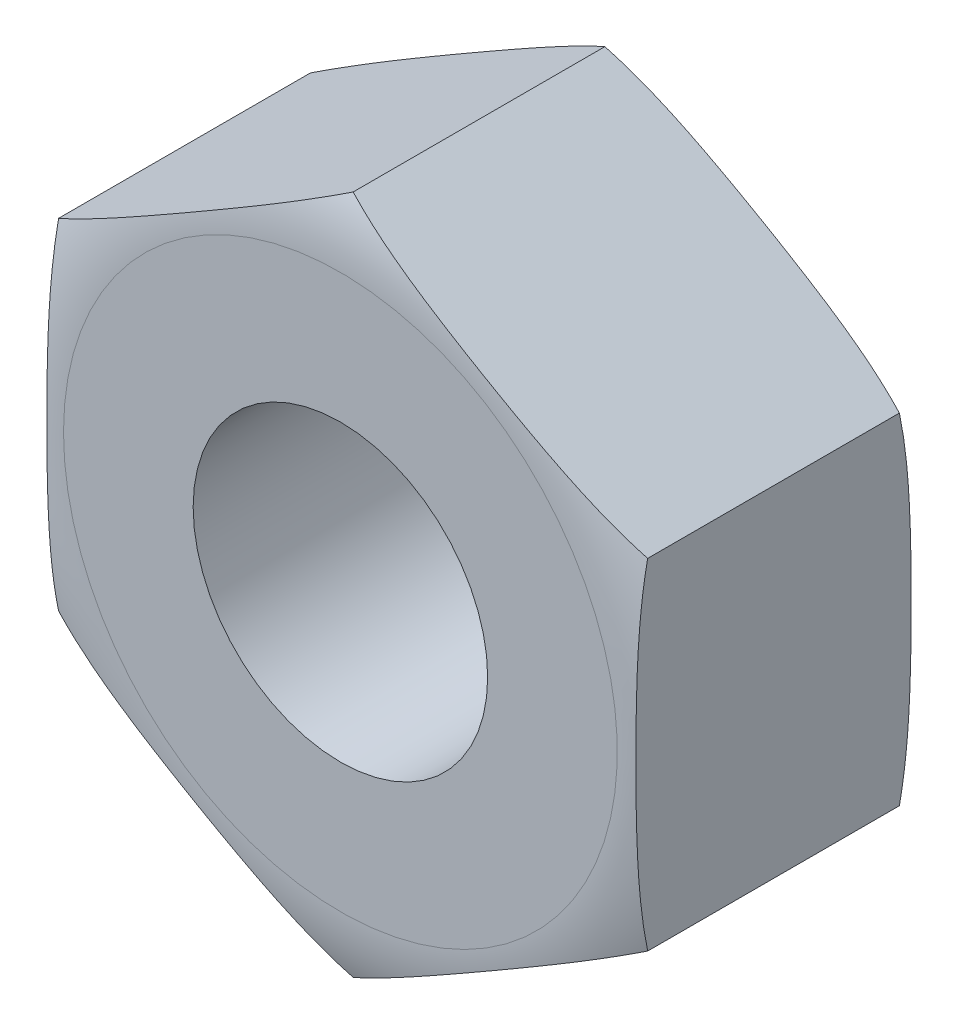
ISO-10303-21;
HEADER;
FILE_DESCRIPTION(('STEP AP214'),'2;1');
FILE_NAME('part.step','',(''),(''),'','','');
FILE_SCHEMA(('AUTOMOTIVE_DESIGN { 1 0 10303 214 1 1 1 1 }'));
ENDSEC;
DATA;
#1=APPLICATION_CONTEXT('core data for automotive mechanical design processes');
#2=APPLICATION_PROTOCOL_DEFINITION('international standard','automotive_design',2000,#1);
#3=PRODUCT_CONTEXT('',#1,'mechanical');
#4=PRODUCT('Part','Part','',(#3));
#5=PRODUCT_RELATED_PRODUCT_CATEGORY('part','',(#4));
#6=PRODUCT_DEFINITION_FORMATION('','',#4);
#7=PRODUCT_DEFINITION_CONTEXT('part definition',#1,'design');
#8=PRODUCT_DEFINITION('design','',#6,#7);
#9=PRODUCT_DEFINITION_SHAPE('','',#8);
#10=(LENGTH_UNIT() NAMED_UNIT(*) SI_UNIT(.MILLI.,.METRE.));
#11=(NAMED_UNIT(*) PLANE_ANGLE_UNIT() SI_UNIT($,.RADIAN.));
#12=(NAMED_UNIT(*) SI_UNIT($,.STERADIAN.) SOLID_ANGLE_UNIT());
#13=UNCERTAINTY_MEASURE_WITH_UNIT(LENGTH_MEASURE(1.E-05),#10,'distance_accuracy_value','');
#14=(GEOMETRIC_REPRESENTATION_CONTEXT(3) GLOBAL_UNCERTAINTY_ASSIGNED_CONTEXT((#13)) GLOBAL_UNIT_ASSIGNED_CONTEXT((#10,
#11,#12)) REPRESENTATION_CONTEXT('',''));
#15=CARTESIAN_POINT('',(0.,0.,0.));
#16=DIRECTION('',(0.,0.,1.));
#17=DIRECTION('',(1.,0.,0.));
#18=AXIS2_PLACEMENT_3D('',#15,#16,#17);
#19=CARTESIAN_POINT('',(0.,0.,0.));
#20=DIRECTION('',(0.,0.,1.));
#21=DIRECTION('',(1.,0.,0.));
#22=AXIS2_PLACEMENT_3D('',#19,#20,#21);
#23=PLANE('',#22);
#24=CARTESIAN_POINT('',(0.,0.,0.));
#25=DIRECTION('',(0.,0.,1.));
#26=DIRECTION('',(1.,0.,0.));
#27=AXIS2_PLACEMENT_3D('',#24,#25,#26);
#28=CIRCLE('',#27,4.25);
#29=CARTESIAN_POINT('',(4.25,0.,0.));
#30=VERTEX_POINT('',#29);
#31=EDGE_CURVE('E114',#30,#30,#28,.T.);
#32=ORIENTED_EDGE('',*,*,#31,.T.);
#33=EDGE_LOOP('',(#32));
#34=FACE_BOUND('',#33,.T.);
#35=CARTESIAN_POINT('',(0.,0.,0.));
#36=DIRECTION('',(0.,0.,-1.));
#37=DIRECTION('',(-1.,0.,0.));
#38=AXIS2_PLACEMENT_3D('',#35,#36,#37);
#39=CIRCLE('',#38,7.99154781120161);
#40=CARTESIAN_POINT('',(-7.99154781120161,0.,0.));
#41=VERTEX_POINT('',#40);
#42=EDGE_CURVE('E97',#41,#41,#39,.T.);
#43=ORIENTED_EDGE('',*,*,#42,.T.);
#44=EDGE_LOOP('',(#43));
#45=FACE_BOUND('',#44,.T.);
#46=ADVANCED_FACE('F37',(#34,#45),#23,.F.);
#47=CARTESIAN_POINT('',(0.,0.,8.));
#48=DIRECTION('',(0.,0.,1.));
#49=DIRECTION('',(1.,0.,0.));
#50=AXIS2_PLACEMENT_3D('',#47,#48,#49);
#51=PLANE('',#50);
#52=CARTESIAN_POINT('',(0.,0.,8.));
#53=DIRECTION('',(0.,0.,1.));
#54=DIRECTION('',(1.,0.,0.));
#55=AXIS2_PLACEMENT_3D('',#52,#53,#54);
#56=CIRCLE('',#55,4.25);
#57=CARTESIAN_POINT('',(4.25,0.,8.));
#58=VERTEX_POINT('',#57);
#59=EDGE_CURVE('E218',#58,#58,#56,.T.);
#60=ORIENTED_EDGE('',*,*,#59,.F.);
#61=EDGE_LOOP('',(#60));
#62=FACE_BOUND('',#61,.T.);
#63=CARTESIAN_POINT('',(0.,0.,8.));
#64=DIRECTION('',(0.,0.,-1.));
#65=DIRECTION('',(-1.,0.,0.));
#66=AXIS2_PLACEMENT_3D('',#63,#64,#65);
#67=CIRCLE('',#66,7.99154781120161);
#68=CARTESIAN_POINT('',(-7.99154781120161,0.,8.));
#69=VERTEX_POINT('',#68);
#70=EDGE_CURVE('E136',#69,#69,#67,.T.);
#71=ORIENTED_EDGE('',*,*,#70,.F.);
#72=EDGE_LOOP('',(#71));
#73=FACE_BOUND('',#72,.T.);
#74=ADVANCED_FACE('F230',(#62,#73),#51,.T.);
#75=CARTESIAN_POINT('',(8.5,-4.90747728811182,8.));
#76=DIRECTION('',(-1.,0.,0.));
#77=DIRECTION('',(0.,0.,1.));
#78=AXIS2_PLACEMENT_3D('',#75,#76,#77);
#79=PLANE('',#78);
#80=DIRECTION('',(0.,0.,-1.));
#81=VECTOR('',#80,1.);
#82=CARTESIAN_POINT('',(8.5,-4.90747728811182,8.));
#83=LINE('',#82,#81);
#84=CARTESIAN_POINT('',(8.5,-4.90747728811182,7.63248179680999));
#85=VERTEX_POINT('',#84);
#86=CARTESIAN_POINT('',(8.5,-4.90747728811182,0.36751820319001));
#87=VERTEX_POINT('',#86);
#88=EDGE_CURVE('E110',#85,#87,#83,.T.);
#89=ORIENTED_EDGE('',*,*,#88,.T.);
#90=CARTESIAN_POINT('',(8.5,0.,0.0275416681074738));
#91=CARTESIAN_POINT('',(8.5,0.306945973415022,0.0275399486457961));
#92=CARTESIAN_POINT('',(8.5,0.613891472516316,0.0292631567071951));
#93=CARTESIAN_POINT('',(8.5,1.22776689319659,0.0371628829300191));
#94=CARTESIAN_POINT('',(8.5,1.53469680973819,0.0433398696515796));
#95=CARTESIAN_POINT('',(8.5,2.14907732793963,0.063069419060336));
#96=CARTESIAN_POINT('',(8.5,2.45652744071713,0.0766394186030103));
#97=CARTESIAN_POINT('',(8.5,3.07067601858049,0.115618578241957));
#98=CARTESIAN_POINT('',(8.5,3.3773746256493,0.141025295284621));
#99=CARTESIAN_POINT('',(8.5,3.92914711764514,0.202619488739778));
#100=CARTESIAN_POINT('',(8.5,4.17454255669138,0.235726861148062));
#101=CARTESIAN_POINT('',(8.5,4.66290049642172,0.316459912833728));
#102=CARTESIAN_POINT('',(8.5,4.90586244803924,0.364088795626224));
#103=CARTESIAN_POINT('',(8.5,5.62698846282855,0.533652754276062));
#104=CARTESIAN_POINT('',(8.5,6.09989063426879,0.682471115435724));
#105=CARTESIAN_POINT('',(8.5,6.81152945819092,0.993541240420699));
#106=CARTESIAN_POINT('',(8.5,7.0644316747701,1.1232562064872));
#107=CARTESIAN_POINT('',(8.5,7.54855861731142,1.41876255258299));
#108=CARTESIAN_POINT('',(8.5,7.77979402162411,1.58453602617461));
#109=CARTESIAN_POINT('',(8.5,8.17755613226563,1.92571125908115));
#110=CARTESIAN_POINT('',(8.5,8.3485744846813,2.09580234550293));
#111=CARTESIAN_POINT('',(8.5,8.58227726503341,2.37025147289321));
#112=CARTESIAN_POINT('',(8.5,8.65639977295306,2.46499607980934));
#113=CARTESIAN_POINT('',(8.5,8.79610151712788,2.66056371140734));
#114=CARTESIAN_POINT('',(8.5,8.86168465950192,2.76138392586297));
#115=CARTESIAN_POINT('',(8.5,8.9839231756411,2.96950249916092));
#116=CARTESIAN_POINT('',(8.5,9.04049518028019,3.07684993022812));
#117=CARTESIAN_POINT('',(8.5,9.14308502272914,3.29642285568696));
#118=CARTESIAN_POINT('',(8.5,9.18910834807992,3.40864577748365));
#119=CARTESIAN_POINT('',(8.5,9.26982690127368,3.63706098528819));
#120=CARTESIAN_POINT('',(8.5,9.30452598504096,3.75325190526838));
#121=CARTESIAN_POINT('',(8.5,9.36197321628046,3.98854703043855));
#122=CARTESIAN_POINT('',(8.5,9.38472333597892,4.10765075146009));
#123=CARTESIAN_POINT('',(8.5,9.41551441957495,4.33068743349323));
#124=CARTESIAN_POINT('',(8.5,9.42517336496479,4.43439978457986));
#125=CARTESIAN_POINT('',(8.5,9.43521421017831,4.6423092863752));
#126=CARTESIAN_POINT('',(8.5,9.43559322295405,4.74650657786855));
#127=CARTESIAN_POINT('',(8.5,9.42705818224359,4.95444890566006));
#128=CARTESIAN_POINT('',(8.5,9.41815081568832,5.05819421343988));
#129=CARTESIAN_POINT('',(8.5,9.39119494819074,5.26450210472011));
#130=CARTESIAN_POINT('',(8.5,9.37314306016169,5.36706423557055));
#131=CARTESIAN_POINT('',(8.5,9.30794725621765,5.66119894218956));
#132=CARTESIAN_POINT('',(8.5,9.24922449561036,5.85032497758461));
#133=CARTESIAN_POINT('',(8.5,9.10258028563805,6.21669107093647));
#134=CARTESIAN_POINT('',(8.5,9.01465749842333,6.3939305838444));
#135=CARTESIAN_POINT('',(8.5,8.80754093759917,6.74315942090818));
#136=CARTESIAN_POINT('',(8.5,8.68682363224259,6.91424113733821));
#137=CARTESIAN_POINT('',(8.5,8.42183529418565,7.23708190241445));
#138=CARTESIAN_POINT('',(8.5,8.2775490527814,7.38882836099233));
#139=CARTESIAN_POINT('',(8.5,8.01232364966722,7.63331068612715));
#140=CARTESIAN_POINT('',(8.5,7.89574270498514,7.73085618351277));
#141=CARTESIAN_POINT('',(8.5,7.65440119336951,7.91529256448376));
#142=CARTESIAN_POINT('',(8.5,7.52963765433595,8.0021795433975));
#143=CARTESIAN_POINT('',(8.5,7.14523497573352,8.24732178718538));
#144=CARTESIAN_POINT('',(8.5,6.87558787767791,8.38996539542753));
#145=CARTESIAN_POINT('',(8.5,6.16491263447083,8.70692625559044));
#146=CARTESIAN_POINT('',(8.5,5.71218724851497,8.85452794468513));
#147=CARTESIAN_POINT('',(8.5,5.02144530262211,9.02499601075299));
#148=CARTESIAN_POINT('',(8.5,4.78883889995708,9.07336934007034));
#149=CARTESIAN_POINT('',(8.5,4.3211195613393,9.156162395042));
#150=CARTESIAN_POINT('',(8.5,4.0860069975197,9.19058416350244));
#151=CARTESIAN_POINT('',(8.5,3.65321823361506,9.2436088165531));
#152=CARTESIAN_POINT('',(8.5,3.45573284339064,9.2638809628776));
#153=CARTESIAN_POINT('',(8.5,3.06022203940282,9.29827742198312));
#154=CARTESIAN_POINT('',(8.5,2.86219659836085,9.31240141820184));
#155=CARTESIAN_POINT('',(8.5,2.46577259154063,9.33592741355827));
#156=CARTESIAN_POINT('',(8.5,2.26737388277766,9.34532688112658));
#157=CARTESIAN_POINT('',(8.5,1.87044530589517,9.36061512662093));
#158=CARTESIAN_POINT('',(8.5,1.67191543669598,9.36650387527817));
#159=CARTESIAN_POINT('',(8.5,1.27420804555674,9.37575509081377));
#160=CARTESIAN_POINT('',(8.5,1.075030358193,9.37910996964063));
#161=CARTESIAN_POINT('',(8.5,0.676655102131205,9.38394488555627));
#162=CARTESIAN_POINT('',(8.5,0.47745753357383,9.38542493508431));
#163=CARTESIAN_POINT('',(8.5,0.0791354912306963,9.38685391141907));
#164=CARTESIAN_POINT('',(8.5,-0.119988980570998,9.38680343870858));
#165=CARTESIAN_POINT('',(8.5,-0.518232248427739,9.38516065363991));
#166=CARTESIAN_POINT('',(8.5,-0.717351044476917,9.38356833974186));
#167=CARTESIAN_POINT('',(8.5,-1.11369033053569,9.37849815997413));
#168=CARTESIAN_POINT('',(8.5,-1.310911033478,9.3750381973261));
#169=CARTESIAN_POINT('',(8.5,-1.70529606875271,9.36556426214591));
#170=CARTESIAN_POINT('',(8.5,-1.90246040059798,9.35955026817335));
#171=CARTESIAN_POINT('',(8.5,-2.29681704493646,9.34399624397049));
#172=CARTESIAN_POINT('',(8.5,-2.49400925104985,9.33445336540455));
#173=CARTESIAN_POINT('',(8.5,-2.8881125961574,9.31063219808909));
#174=CARTESIAN_POINT('',(8.5,-3.08502373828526,9.29635396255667));
#175=CARTESIAN_POINT('',(8.5,-3.47688873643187,9.26177960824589));
#176=CARTESIAN_POINT('',(8.5,-3.67184635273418,9.24152841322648));
#177=CARTESIAN_POINT('',(8.5,-4.06081687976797,9.19345120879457));
#178=CARTESIAN_POINT('',(8.5,-4.25482971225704,9.16562458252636));
#179=CARTESIAN_POINT('',(8.5,-4.83399053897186,9.06843304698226));
#180=CARTESIAN_POINT('',(8.5,-5.21712643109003,8.9852947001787));
#181=CARTESIAN_POINT('',(8.5,-5.8666391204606,8.79833620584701));
#182=CARTESIAN_POINT('',(8.5,-6.13637907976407,8.70632786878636));
#183=CARTESIAN_POINT('',(8.5,-6.66370840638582,8.49043342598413));
#184=CARTESIAN_POINT('',(8.5,-6.92127995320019,8.36650218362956));
#185=CARTESIAN_POINT('',(8.5,-7.29342989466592,8.15318580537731));
#186=CARTESIAN_POINT('',(8.5,-7.41568651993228,8.07706023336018));
#187=CARTESIAN_POINT('',(8.5,-7.65376567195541,7.91537662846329));
#188=CARTESIAN_POINT('',(8.5,-7.76959119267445,7.8298230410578));
#189=CARTESIAN_POINT('',(8.5,-7.99336746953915,7.6491808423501));
#190=CARTESIAN_POINT('',(8.5,-8.10132668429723,7.55410274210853));
#191=CARTESIAN_POINT('',(8.5,-8.30800571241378,7.3543841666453));
#192=CARTESIAN_POINT('',(8.5,-8.40672834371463,7.24974662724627));
#193=CARTESIAN_POINT('',(8.5,-8.57142184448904,7.05691910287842));
#194=CARTESIAN_POINT('',(8.5,-8.63963819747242,6.97064068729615));
#195=CARTESIAN_POINT('',(8.5,-8.76901315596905,6.79295453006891));
#196=CARTESIAN_POINT('',(8.5,-8.83017332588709,6.70154793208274));
#197=CARTESIAN_POINT('',(8.5,-8.94473180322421,6.51397472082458));
#198=CARTESIAN_POINT('',(8.5,-8.99812953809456,6.4178077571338));
#199=CARTESIAN_POINT('',(8.5,-9.09644944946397,6.22128051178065));
#200=CARTESIAN_POINT('',(8.5,-9.14137559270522,6.12092221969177));
#201=CARTESIAN_POINT('',(8.5,-9.22239786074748,5.91600802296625));
#202=CARTESIAN_POINT('',(8.5,-9.25844035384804,5.81143085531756));
#203=CARTESIAN_POINT('',(8.5,-9.32079632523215,5.59945711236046));
#204=CARTESIAN_POINT('',(8.5,-9.34711400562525,5.49206177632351));
#205=CARTESIAN_POINT('',(8.5,-9.38962783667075,5.27528613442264));
#206=CARTESIAN_POINT('',(8.5,-9.40582437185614,5.16590590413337));
#207=CARTESIAN_POINT('',(8.5,-9.4278325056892,4.94610879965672));
#208=CARTESIAN_POINT('',(8.5,-9.4336449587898,4.83569201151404));
#209=CARTESIAN_POINT('',(8.5,-9.43474116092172,4.62482098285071));
#210=CARTESIAN_POINT('',(8.5,-9.43093101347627,4.52437038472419));
#211=CARTESIAN_POINT('',(8.5,-9.4146990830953,4.32413314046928));
#212=CARTESIAN_POINT('',(8.5,-9.40227437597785,4.22434673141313));
#213=CARTESIAN_POINT('',(8.5,-9.36898264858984,4.02624785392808));
#214=CARTESIAN_POINT('',(8.5,-9.34812037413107,3.92793458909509));
#215=CARTESIAN_POINT('',(8.5,-9.2982360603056,3.73338831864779));
#216=CARTESIAN_POINT('',(8.5,-9.26921093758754,3.6371561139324));
#217=CARTESIAN_POINT('',(8.5,-9.17098349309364,3.35422859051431));
#218=CARTESIAN_POINT('',(8.5,-9.09029939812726,3.17139563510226));
#219=CARTESIAN_POINT('',(8.5,-8.90190668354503,2.8204255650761));
#220=CARTESIAN_POINT('',(8.5,-8.79419103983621,2.65229228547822));
#221=CARTESIAN_POINT('',(8.5,-8.54495620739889,2.31837304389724));
#222=CARTESIAN_POINT('',(8.5,-8.40123401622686,2.15423754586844));
#223=CARTESIAN_POINT('',(8.5,-8.09214461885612,1.84787930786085));
#224=CARTESIAN_POINT('',(8.5,-7.92676654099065,1.70566765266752));
#225=CARTESIAN_POINT('',(8.5,-7.61861492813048,1.47275820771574));
#226=CARTESIAN_POINT('',(8.5,-7.47911029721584,1.37766509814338));
#227=CARTESIAN_POINT('',(8.5,-7.19219781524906,1.20018612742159));
#228=CARTESIAN_POINT('',(8.5,-7.04478621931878,1.11780636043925));
#229=CARTESIAN_POINT('',(8.5,-6.59305634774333,0.888582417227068));
#230=CARTESIAN_POINT('',(8.5,-6.2794916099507,0.759834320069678));
#231=CARTESIAN_POINT('',(8.5,-5.61753223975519,0.535905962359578));
#232=CARTESIAN_POINT('',(8.5,-5.2682166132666,0.443587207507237));
#233=CARTESIAN_POINT('',(8.5,-4.56175170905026,0.294609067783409));
#234=CARTESIAN_POINT('',(8.5,-4.20458959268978,0.238013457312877));
#235=CARTESIAN_POINT('',(8.5,-3.66597240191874,0.172187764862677));
#236=CARTESIAN_POINT('',(8.5,-3.48555765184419,0.153403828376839));
#237=CARTESIAN_POINT('',(8.5,-3.12425617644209,0.121074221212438));
#238=CARTESIAN_POINT('',(8.5,-2.94336946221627,0.107528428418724));
#239=CARTESIAN_POINT('',(8.5,-2.58145990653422,0.0845789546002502));
#240=CARTESIAN_POINT('',(8.5,-2.40043722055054,0.0751726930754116));
#241=CARTESIAN_POINT('',(8.5,-2.03826088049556,0.0595257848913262));
#242=CARTESIAN_POINT('',(8.5,-1.85710722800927,0.0532851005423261));
#243=CARTESIAN_POINT('',(8.5,-1.53612547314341,0.0443282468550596));
#244=CARTESIAN_POINT('',(8.5,-1.39630993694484,0.0411326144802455));
#245=CARTESIAN_POINT('',(8.5,-1.1166595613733,0.0358714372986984));
#246=CARTESIAN_POINT('',(8.5,-0.976824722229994,0.0338058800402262));
#247=CARTESIAN_POINT('',(8.5,-0.558003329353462,0.028969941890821));
#248=CARTESIAN_POINT('',(8.5,-0.279001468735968,0.0275432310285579));
#249=CARTESIAN_POINT('',(8.5,0.,0.0275416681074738));
#250=B_SPLINE_CURVE_WITH_KNOTS('',3,(#90,#91,#92,#93,#94,#95,#96,#97,#98,#99,#100,#101,#102,
#103,#104,#105,#106,#107,#108,#109,#110,#111,#112,#113,#114,#115,#116,#117,#118,#119,#120,#121,
#122,#123,#124,#125,#126,#127,#128,#129,#130,#131,#132,#133,#134,#135,#136,#137,#138,#139,#140,
#141,#142,#143,#144,#145,#146,#147,#148,#149,#150,#151,#152,#153,#154,#155,#156,#157,#158,#159,
#160,#161,#162,#163,#164,#165,#166,#167,#168,#169,#170,#171,#172,#173,#174,#175,#176,#177,#178,
#179,#180,#181,#182,#183,#184,#185,#186,#187,#188,#189,#190,#191,#192,#193,#194,#195,#196,#197,
#198,#199,#200,#201,#202,#203,#204,#205,#206,#207,#208,#209,#210,#211,#212,#213,#214,#215,#216,
#217,#218,#219,#220,#221,#222,#223,#224,#225,#226,#227,#228,#229,#230,#231,#232,#233,#234,#235,
#236,#237,#238,#239,#240,#241,#242,#243,#244,#245,#246,#247,#248,#249),.UNSPECIFIED.,.T.,.F.,(4,
2,2,2,2,2,2,2,2,2,2,2,2,2,2,2,2,2,2,2,2,2,2,2,2,2,2,2,2,2,2,2,2,2,2,2,2,2,2,2,2,2,2,2,2,2,2,2,2,
2,2,2,2,2,2,2,2,2,2,2,2,2,2,2,2,2,2,2,2,2,2,2,2,2,2,2,2,2,2,4),(0.,0.920830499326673,
1.84175788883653,2.76486680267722,3.68778527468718,4.43021017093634,5.17279896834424,
6.65050528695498,7.50074333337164,8.35056011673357,9.07096222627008,9.43145903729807,
9.79179036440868,10.1552828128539,10.5185857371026,10.8817648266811,11.2448839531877,
11.5569657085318,11.869144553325,12.1810987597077,12.4931685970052,13.0843958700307,
13.6756502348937,14.3013542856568,14.9274637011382,15.3828887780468,15.8384802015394,
16.7500763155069,18.170166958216,18.8827072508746,19.5951431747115,20.1906178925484,
20.7861232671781,21.3819473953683,21.977776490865,22.5753828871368,23.1729853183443,
23.7703532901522,24.3677218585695,24.9594632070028,25.5512095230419,26.1434345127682,
26.7356528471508,27.3235258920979,27.9114468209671,29.0846927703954,29.9381851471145,
30.7928909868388,31.2245791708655,31.6560646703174,32.0870791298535,32.517961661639,
32.8476113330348,33.1771877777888,33.5067885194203,33.8362345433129,34.1676232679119,
34.498868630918,34.8301014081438,35.161306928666,35.4625082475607,35.7638118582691,
36.0649462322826,36.3661945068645,36.9629567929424,37.5598743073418,38.2119128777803,
38.8642800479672,39.370083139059,39.8761279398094,40.8891280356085,41.970685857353,
43.0541690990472,43.5982896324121,44.1423974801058,44.6861656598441,45.2299273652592,
45.6494786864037,46.0690253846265,46.9060230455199),.UNSPECIFIED.);
#251=CARTESIAN_POINT('',(8.5,4.90747728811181,0.367518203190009));
#252=VERTEX_POINT('',#251);
#253=EDGE_CURVE('E53',#87,#252,#250,.T.);
#254=ORIENTED_EDGE('',*,*,#253,.T.);
#255=DIRECTION('',(0.,0.,-1.));
#256=VECTOR('',#255,1.);
#257=CARTESIAN_POINT('',(8.5,4.90747728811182,8.));
#258=LINE('',#257,#256);
#259=CARTESIAN_POINT('',(8.5,4.90747728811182,7.63248179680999));
#260=VERTEX_POINT('',#259);
#261=EDGE_CURVE('E11',#260,#252,#258,.T.);
#262=ORIENTED_EDGE('',*,*,#261,.F.);
#263=CARTESIAN_POINT('',(8.5,0.,7.97245833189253));
#264=CARTESIAN_POINT('',(8.5,-0.30694597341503,7.9724600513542));
#265=CARTESIAN_POINT('',(8.5,-0.613891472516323,7.9707368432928));
#266=CARTESIAN_POINT('',(8.5,-1.22776689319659,7.96283711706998));
#267=CARTESIAN_POINT('',(8.5,-1.5346968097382,7.95666013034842));
#268=CARTESIAN_POINT('',(8.5,-2.14907732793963,7.93693058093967));
#269=CARTESIAN_POINT('',(8.5,-2.45652744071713,7.92336058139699));
#270=CARTESIAN_POINT('',(8.5,-3.07067601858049,7.88438142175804));
#271=CARTESIAN_POINT('',(8.5,-3.3773746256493,7.85897470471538));
#272=CARTESIAN_POINT('',(8.5,-3.92914711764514,7.79738051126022));
#273=CARTESIAN_POINT('',(8.5,-4.17454255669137,7.76427313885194));
#274=CARTESIAN_POINT('',(8.5,-4.66290049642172,7.68354008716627));
#275=CARTESIAN_POINT('',(8.5,-4.90586244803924,7.63591120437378));
#276=CARTESIAN_POINT('',(8.5,-5.62698846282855,7.46634724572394));
#277=CARTESIAN_POINT('',(8.5,-6.09989063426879,7.31752888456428));
#278=CARTESIAN_POINT('',(8.5,-6.81152945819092,7.0064587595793));
#279=CARTESIAN_POINT('',(8.5,-7.0644316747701,6.8767437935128));
#280=CARTESIAN_POINT('',(8.5,-7.54855861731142,6.581237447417));
#281=CARTESIAN_POINT('',(8.5,-7.77979402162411,6.41546397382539));
#282=CARTESIAN_POINT('',(8.5,-8.17755613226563,6.07428874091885));
#283=CARTESIAN_POINT('',(8.5,-8.3485744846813,5.90419765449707));
#284=CARTESIAN_POINT('',(8.5,-8.58227726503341,5.62974852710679));
#285=CARTESIAN_POINT('',(8.5,-8.65639977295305,5.53500392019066));
#286=CARTESIAN_POINT('',(8.5,-8.79610151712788,5.33943628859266));
#287=CARTESIAN_POINT('',(8.5,-8.86168465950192,5.23861607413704));
#288=CARTESIAN_POINT('',(8.5,-8.9839231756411,5.03049750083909));
#289=CARTESIAN_POINT('',(8.5,-9.04049518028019,4.92315006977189));
#290=CARTESIAN_POINT('',(8.5,-9.14308502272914,4.70357714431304));
#291=CARTESIAN_POINT('',(8.5,-9.18910834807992,4.59135422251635));
#292=CARTESIAN_POINT('',(8.5,-9.26982690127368,4.36293901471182));
#293=CARTESIAN_POINT('',(8.5,-9.30452598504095,4.24674809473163));
#294=CARTESIAN_POINT('',(8.5,-9.36197321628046,4.01145296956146));
#295=CARTESIAN_POINT('',(8.5,-9.38472333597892,3.89234924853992));
#296=CARTESIAN_POINT('',(8.5,-9.41551441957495,3.66931256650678));
#297=CARTESIAN_POINT('',(8.5,-9.42517336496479,3.56560021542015));
#298=CARTESIAN_POINT('',(8.5,-9.43521421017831,3.35769071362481));
#299=CARTESIAN_POINT('',(8.5,-9.43559322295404,3.25349342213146));
#300=CARTESIAN_POINT('',(8.5,-9.42705818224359,3.04555109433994));
#301=CARTESIAN_POINT('',(8.5,-9.41815081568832,2.94180578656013));
#302=CARTESIAN_POINT('',(8.5,-9.39119494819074,2.73549789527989));
#303=CARTESIAN_POINT('',(8.5,-9.37314306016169,2.63293576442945));
#304=CARTESIAN_POINT('',(8.5,-9.30794725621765,2.33880105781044));
#305=CARTESIAN_POINT('',(8.5,-9.24922449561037,2.14967502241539));
#306=CARTESIAN_POINT('',(8.5,-9.10258028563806,1.78330892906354));
#307=CARTESIAN_POINT('',(8.5,-9.01465749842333,1.60606941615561));
#308=CARTESIAN_POINT('',(8.5,-8.80754093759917,1.25684057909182));
#309=CARTESIAN_POINT('',(8.5,-8.68682363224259,1.0857588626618));
#310=CARTESIAN_POINT('',(8.5,-8.42183529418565,0.762918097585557));
#311=CARTESIAN_POINT('',(8.5,-8.27754905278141,0.611171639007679));
#312=CARTESIAN_POINT('',(8.5,-8.01232364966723,0.366689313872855));
#313=CARTESIAN_POINT('',(8.5,-7.89574270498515,0.269143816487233));
#314=CARTESIAN_POINT('',(8.5,-7.65440119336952,0.084707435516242));
#315=CARTESIAN_POINT('',(8.5,-7.52963765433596,-0.00217954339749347));
#316=CARTESIAN_POINT('',(8.5,-7.14523497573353,-0.247321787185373));
#317=CARTESIAN_POINT('',(8.5,-6.87558787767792,-0.389965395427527));
#318=CARTESIAN_POINT('',(8.5,-6.16491263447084,-0.70692625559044));
#319=CARTESIAN_POINT('',(8.5,-5.71218724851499,-0.854527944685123));
#320=CARTESIAN_POINT('',(8.5,-5.02144530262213,-1.02499601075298));
#321=CARTESIAN_POINT('',(8.5,-4.78883889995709,-1.07336934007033));
#322=CARTESIAN_POINT('',(8.5,-4.32111956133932,-1.156162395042));
#323=CARTESIAN_POINT('',(8.5,-4.08600699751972,-1.19058416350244));
#324=CARTESIAN_POINT('',(8.5,-3.65321823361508,-1.2436088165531));
#325=CARTESIAN_POINT('',(8.5,-3.45573284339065,-1.2638809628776));
#326=CARTESIAN_POINT('',(8.5,-3.06022203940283,-1.29827742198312));
#327=CARTESIAN_POINT('',(8.5,-2.86219659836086,-1.31240141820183));
#328=CARTESIAN_POINT('',(8.5,-2.46577259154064,-1.33592741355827));
#329=CARTESIAN_POINT('',(8.5,-2.26737388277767,-1.34532688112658));
#330=CARTESIAN_POINT('',(8.5,-1.87044530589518,-1.36061512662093));
#331=CARTESIAN_POINT('',(8.5,-1.67191543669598,-1.36650387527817));
#332=CARTESIAN_POINT('',(8.5,-1.27420804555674,-1.37575509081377));
#333=CARTESIAN_POINT('',(8.5,-1.075030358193,-1.37910996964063));
#334=CARTESIAN_POINT('',(8.5,-0.6766551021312,-1.38394488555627));
#335=CARTESIAN_POINT('',(8.5,-0.477457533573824,-1.38542493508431));
#336=CARTESIAN_POINT('',(8.5,-0.0791354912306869,-1.38685391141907));
#337=CARTESIAN_POINT('',(8.5,0.11998898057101,-1.38680343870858));
#338=CARTESIAN_POINT('',(8.5,0.518232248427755,-1.38516065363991));
#339=CARTESIAN_POINT('',(8.5,0.717351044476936,-1.38356833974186));
#340=CARTESIAN_POINT('',(8.5,1.11369033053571,-1.37849815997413));
#341=CARTESIAN_POINT('',(8.5,1.31091103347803,-1.3750381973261));
#342=CARTESIAN_POINT('',(8.5,1.70529606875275,-1.36556426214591));
#343=CARTESIAN_POINT('',(8.5,1.90246040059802,-1.35955026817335));
#344=CARTESIAN_POINT('',(8.5,2.2968170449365,-1.34399624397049));
#345=CARTESIAN_POINT('',(8.5,2.49400925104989,-1.33445336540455));
#346=CARTESIAN_POINT('',(8.5,2.88811259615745,-1.31063219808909));
#347=CARTESIAN_POINT('',(8.5,3.08502373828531,-1.29635396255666));
#348=CARTESIAN_POINT('',(8.5,3.47688873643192,-1.26177960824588));
#349=CARTESIAN_POINT('',(8.5,3.67184635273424,-1.24152841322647));
#350=CARTESIAN_POINT('',(8.5,4.06081687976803,-1.19345120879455));
#351=CARTESIAN_POINT('',(8.5,4.25482971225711,-1.16562458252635));
#352=CARTESIAN_POINT('',(8.5,4.83399053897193,-1.06843304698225));
#353=CARTESIAN_POINT('',(8.5,5.21712643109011,-0.985294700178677));
#354=CARTESIAN_POINT('',(8.5,5.86663912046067,-0.798336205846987));
#355=CARTESIAN_POINT('',(8.5,6.13637907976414,-0.706327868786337));
#356=CARTESIAN_POINT('',(8.5,6.66370840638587,-0.490433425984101));
#357=CARTESIAN_POINT('',(8.5,6.92127995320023,-0.366502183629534));
#358=CARTESIAN_POINT('',(8.5,7.29342989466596,-0.153185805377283));
#359=CARTESIAN_POINT('',(8.5,7.41568651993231,-0.0770602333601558));
#360=CARTESIAN_POINT('',(8.5,7.65376567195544,0.0846233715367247));
#361=CARTESIAN_POINT('',(8.5,7.76959119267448,0.170176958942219));
#362=CARTESIAN_POINT('',(8.5,7.99336746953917,0.350819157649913));
#363=CARTESIAN_POINT('',(8.5,8.10132668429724,0.445897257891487));
#364=CARTESIAN_POINT('',(8.5,8.30800571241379,0.645615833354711));
#365=CARTESIAN_POINT('',(8.5,8.40672834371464,0.750253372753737));
#366=CARTESIAN_POINT('',(8.5,8.57142184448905,0.943080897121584));
#367=CARTESIAN_POINT('',(8.5,8.63963819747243,1.02935931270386));
#368=CARTESIAN_POINT('',(8.5,8.76901315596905,1.20704546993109));
#369=CARTESIAN_POINT('',(8.5,8.83017332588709,1.29845206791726));
#370=CARTESIAN_POINT('',(8.5,8.94473180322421,1.48602527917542));
#371=CARTESIAN_POINT('',(8.5,8.99812953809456,1.58219224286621));
#372=CARTESIAN_POINT('',(8.5,9.09644944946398,1.77871948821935));
#373=CARTESIAN_POINT('',(8.5,9.14137559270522,1.87907778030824));
#374=CARTESIAN_POINT('',(8.5,9.22239786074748,2.08399197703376));
#375=CARTESIAN_POINT('',(8.5,9.25844035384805,2.18856914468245));
#376=CARTESIAN_POINT('',(8.5,9.32079632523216,2.40054288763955));
#377=CARTESIAN_POINT('',(8.5,9.34711400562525,2.5079382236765));
#378=CARTESIAN_POINT('',(8.5,9.38962783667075,2.72471386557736));
#379=CARTESIAN_POINT('',(8.5,9.40582437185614,2.83409409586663));
#380=CARTESIAN_POINT('',(8.5,9.4278325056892,3.05389120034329));
#381=CARTESIAN_POINT('',(8.5,9.4336449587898,3.16430798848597));
#382=CARTESIAN_POINT('',(8.5,9.43474116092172,3.3751790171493));
#383=CARTESIAN_POINT('',(8.5,9.43093101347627,3.47562961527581));
#384=CARTESIAN_POINT('',(8.5,9.4146990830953,3.67586685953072));
#385=CARTESIAN_POINT('',(8.5,9.40227437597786,3.77565326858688));
#386=CARTESIAN_POINT('',(8.5,9.36898264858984,3.97375214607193));
#387=CARTESIAN_POINT('',(8.5,9.34812037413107,4.07206541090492));
#388=CARTESIAN_POINT('',(8.5,9.2982360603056,4.26661168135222));
#389=CARTESIAN_POINT('',(8.5,9.26921093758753,4.36284388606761));
#390=CARTESIAN_POINT('',(8.5,9.17098349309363,4.6457714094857));
#391=CARTESIAN_POINT('',(8.5,9.09029939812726,4.82860436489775));
#392=CARTESIAN_POINT('',(8.5,8.90190668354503,5.17957443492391));
#393=CARTESIAN_POINT('',(8.5,8.79419103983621,5.34770771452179));
#394=CARTESIAN_POINT('',(8.5,8.54495620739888,5.68162695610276));
#395=CARTESIAN_POINT('',(8.5,8.40123401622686,5.84576245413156));
#396=CARTESIAN_POINT('',(8.5,8.09214461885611,6.15212069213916));
#397=CARTESIAN_POINT('',(8.5,7.92676654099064,6.29433234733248));
#398=CARTESIAN_POINT('',(8.5,7.61861492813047,6.52724179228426));
#399=CARTESIAN_POINT('',(8.5,7.47911029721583,6.62233490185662));
#400=CARTESIAN_POINT('',(8.5,7.19219781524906,6.79981387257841));
#401=CARTESIAN_POINT('',(8.5,7.04478621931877,6.88219363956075));
#402=CARTESIAN_POINT('',(8.5,6.59305634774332,7.11141758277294));
#403=CARTESIAN_POINT('',(8.5,6.27949160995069,7.24016567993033));
#404=CARTESIAN_POINT('',(8.5,5.61753223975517,7.46409403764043));
#405=CARTESIAN_POINT('',(8.5,5.26821661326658,7.55641279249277));
#406=CARTESIAN_POINT('',(8.5,4.56175170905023,7.70539093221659));
#407=CARTESIAN_POINT('',(8.5,4.20458959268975,7.76198654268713));
#408=CARTESIAN_POINT('',(8.5,3.6659724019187,7.82781223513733));
#409=CARTESIAN_POINT('',(8.5,3.48555765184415,7.84659617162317));
#410=CARTESIAN_POINT('',(8.5,3.12425617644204,7.87892577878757));
#411=CARTESIAN_POINT('',(8.5,2.94336946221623,7.89247157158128));
#412=CARTESIAN_POINT('',(8.5,2.58145990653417,7.91542104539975));
#413=CARTESIAN_POINT('',(8.5,2.40043722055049,7.92482730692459));
#414=CARTESIAN_POINT('',(8.5,2.0382608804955,7.94047421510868));
#415=CARTESIAN_POINT('',(8.5,1.85710722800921,7.94671489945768));
#416=CARTESIAN_POINT('',(8.5,1.53612547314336,7.95567175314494));
#417=CARTESIAN_POINT('',(8.5,1.39630993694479,7.95886738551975));
#418=CARTESIAN_POINT('',(8.5,1.11665956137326,7.9641285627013));
#419=CARTESIAN_POINT('',(8.5,0.976824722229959,7.96619411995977));
#420=CARTESIAN_POINT('',(8.5,0.558003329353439,7.97103005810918));
#421=CARTESIAN_POINT('',(8.5,0.279001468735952,7.97245676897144));
#422=CARTESIAN_POINT('',(8.5,0.,7.97245833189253));
#423=B_SPLINE_CURVE_WITH_KNOTS('',3,(#263,#264,#265,#266,#267,#268,#269,#270,#271,#272,#273,
#274,#275,#276,#277,#278,#279,#280,#281,#282,#283,#284,#285,#286,#287,#288,#289,#290,#291,#292,
#293,#294,#295,#296,#297,#298,#299,#300,#301,#302,#303,#304,#305,#306,#307,#308,#309,#310,#311,
#312,#313,#314,#315,#316,#317,#318,#319,#320,#321,#322,#323,#324,#325,#326,#327,#328,#329,#330,
#331,#332,#333,#334,#335,#336,#337,#338,#339,#340,#341,#342,#343,#344,#345,#346,#347,#348,#349,
#350,#351,#352,#353,#354,#355,#356,#357,#358,#359,#360,#361,#362,#363,#364,#365,#366,#367,#368,
#369,#370,#371,#372,#373,#374,#375,#376,#377,#378,#379,#380,#381,#382,#383,#384,#385,#386,#387,
#388,#389,#390,#391,#392,#393,#394,#395,#396,#397,#398,#399,#400,#401,#402,#403,#404,#405,#406,
#407,#408,#409,#410,#411,#412,#413,#414,#415,#416,#417,#418,#419,#420,#421,#422),.UNSPECIFIED.,
.T.,.F.,(4,2,2,2,2,2,2,2,2,2,2,2,2,2,2,2,2,2,2,2,2,2,2,2,2,2,2,2,2,2,2,2,2,2,2,2,2,2,2,2,2,2,2,
2,2,2,2,2,2,2,2,2,2,2,2,2,2,2,2,2,2,2,2,2,2,2,2,2,2,2,2,2,2,2,2,2,2,2,2,4),(0.,0.92083049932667,
1.84175788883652,2.76486680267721,3.68778527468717,4.43021017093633,5.17279896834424,
6.65050528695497,7.50074333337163,8.35056011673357,9.07096222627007,9.43145903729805,
9.79179036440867,10.1552828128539,10.5185857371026,10.8817648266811,11.2448839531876,
11.5569657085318,11.869144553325,12.1810987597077,12.4931685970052,13.0843958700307,
13.6756502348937,14.3013542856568,14.9274637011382,15.3828887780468,15.8384802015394,
16.7500763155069,18.170166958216,18.8827072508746,19.5951431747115,20.1906178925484,
20.7861232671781,21.3819473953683,21.977776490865,22.5753828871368,23.1729853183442,
23.7703532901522,24.3677218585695,24.9594632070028,25.5512095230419,26.1434345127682,
26.7356528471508,27.323525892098,27.9114468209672,29.0846927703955,29.9381851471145,
30.7928909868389,31.2245791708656,31.6560646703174,32.0870791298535,32.517961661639,
32.8476113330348,33.1771877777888,33.5067885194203,33.8362345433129,34.1676232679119,
34.498868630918,34.8301014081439,35.161306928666,35.4625082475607,35.7638118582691,
36.0649462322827,36.3661945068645,36.9629567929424,37.5598743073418,38.2119128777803,
38.8642800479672,39.370083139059,39.8761279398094,40.8891280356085,41.970685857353,
43.0541690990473,43.5982896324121,44.1423974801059,44.6861656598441,45.2299273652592,
45.6494786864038,46.0690253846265,46.9060230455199),.UNSPECIFIED.);
#424=EDGE_CURVE('E212',#260,#85,#423,.T.);
#425=ORIENTED_EDGE('',*,*,#424,.T.);
#426=EDGE_LOOP('',(#89,#254,#262,#425));
#427=FACE_BOUND('',#426,.T.);
#428=ADVANCED_FACE('F39',(#427),#79,.F.);
#429=CARTESIAN_POINT('',(8.5,4.90747728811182,8.));
#430=DIRECTION('',(-0.5,-0.866025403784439,0.));
#431=DIRECTION('',(0.866025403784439,-0.5,0.));
#432=AXIS2_PLACEMENT_3D('',#429,#430,#431);
#433=PLANE('',#432);
#434=ORIENTED_EDGE('',*,*,#261,.T.);
#435=CARTESIAN_POINT('',(8.5002,4.90736181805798,0.367566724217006));
#436=CARTESIAN_POINT('',(8.36162306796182,4.9873692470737,0.333955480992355));
#437=CARTESIAN_POINT('',(8.22241947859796,5.06773847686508,0.304008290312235));
#438=CARTESIAN_POINT('',(7.9431635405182,5.22896696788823,0.250499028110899));
#439=CARTESIAN_POINT('',(7.80311167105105,5.3098259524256,0.226933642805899));
#440=CARTESIAN_POINT('',(7.52270583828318,5.47171833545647,0.185254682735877));
#441=CARTESIAN_POINT('',(7.38235307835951,5.55275103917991,0.167130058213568));
#442=CARTESIAN_POINT('',(7.1012523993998,5.71504459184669,0.135379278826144));
#443=CARTESIAN_POINT('',(6.96050442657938,5.79630547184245,0.121753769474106));
#444=CARTESIAN_POINT('',(6.53790752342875,6.04029190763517,0.0863558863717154));
#445=CARTESIAN_POINT('',(6.25572018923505,6.2032128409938,0.0700641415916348));
#446=CARTESIAN_POINT('',(5.69095695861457,6.52927904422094,0.0464513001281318));
#447=CARTESIAN_POINT('',(5.40838093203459,6.69242438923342,0.0391353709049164));
#448=CARTESIAN_POINT('',(4.84625871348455,7.01696580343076,0.0298036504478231));
#449=CARTESIAN_POINT('',(4.56671315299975,7.17836150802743,0.0277308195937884));
#450=CARTESIAN_POINT('',(4.00765171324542,7.50113578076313,0.02737608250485));
#451=CARTESIAN_POINT('',(3.72813583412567,7.66251434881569,0.0290937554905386));
#452=CARTESIAN_POINT('',(3.16916653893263,7.98523542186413,0.0374480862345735));
#453=CARTESIAN_POINT('',(2.8897131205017,8.14657792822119,0.0440845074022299));
#454=CARTESIAN_POINT('',(2.33105079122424,8.46912177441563,0.0656955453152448));
#455=CARTESIAN_POINT('',(2.05184184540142,8.63032313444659,0.0806686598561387));
#456=CARTESIAN_POINT('',(1.6244394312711,8.87708403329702,0.114069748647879));
#457=CARTESIAN_POINT('',(1.47596607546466,8.96280516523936,0.127617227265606));
#458=CARTESIAN_POINT('',(1.17946538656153,9.13398991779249,0.159553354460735));
#459=CARTESIAN_POINT('',(1.0314378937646,9.21945363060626,0.177939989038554));
#460=CARTESIAN_POINT('',(0.735604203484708,9.39025329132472,0.220643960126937));
#461=CARTESIAN_POINT('',(0.587799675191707,9.47558827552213,0.244977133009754));
#462=CARTESIAN_POINT('',(0.293031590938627,9.64577270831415,0.30069721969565));
#463=CARTESIAN_POINT('',(0.146069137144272,9.73062152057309,0.3320918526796));
#464=CARTESIAN_POINT('',(-0.000199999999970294,9.81507004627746,0.367566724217));
#465=B_SPLINE_CURVE_WITH_KNOTS('',3,(#435,#436,#437,#438,#439,#440,#441,#442,#443,#444,#445,
#446,#447,#448,#449,#450,#451,#452,#453,#454,#455,#456,#457,#458,#459,#460,#461,#462,#463,#464),
.UNSPECIFIED.,.F.,.F.,(4,2,2,2,2,2,2,2,2,2,2,2,2,2,4),(0.,0.490412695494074,0.980570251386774,
1.4697254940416,1.95895088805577,2.93745247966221,3.91651713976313,4.88488384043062,
5.85314304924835,6.82135568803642,7.78939391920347,8.30526923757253,8.82093019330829,
9.33797967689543,9.85559714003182),.UNSPECIFIED.);
#466=CARTESIAN_POINT('',(0.,9.81495457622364,0.367518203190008));
#467=VERTEX_POINT('',#466);
#468=EDGE_CURVE('E134',#252,#467,#465,.T.);
#469=ORIENTED_EDGE('',*,*,#468,.T.);
#470=DIRECTION('',(0.,0.,-1.));
#471=VECTOR('',#470,1.);
#472=CARTESIAN_POINT('',(0.,9.81495457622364,8.));
#473=LINE('',#472,#471);
#474=CARTESIAN_POINT('',(0.,9.81495457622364,7.63248179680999));
#475=VERTEX_POINT('',#474);
#476=EDGE_CURVE('E46',#475,#467,#473,.T.);
#477=ORIENTED_EDGE('',*,*,#476,.F.);
#478=CARTESIAN_POINT('',(-0.000199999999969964,9.81507004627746,7.632433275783));
#479=CARTESIAN_POINT('',(0.138376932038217,9.73506261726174,7.66604451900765));
#480=CARTESIAN_POINT('',(0.277580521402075,9.65469338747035,7.69599170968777));
#481=CARTESIAN_POINT('',(0.556836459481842,9.4934648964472,7.74950097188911));
#482=CARTESIAN_POINT('',(0.69688832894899,9.41260591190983,7.77306635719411));
#483=CARTESIAN_POINT('',(0.977294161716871,9.25071352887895,7.81474531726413));
#484=CARTESIAN_POINT('',(1.11764692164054,9.16968082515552,7.83286994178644));
#485=CARTESIAN_POINT('',(1.39874760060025,9.00738727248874,7.86462072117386));
#486=CARTESIAN_POINT('',(1.53949557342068,8.92612639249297,7.8782462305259));
#487=CARTESIAN_POINT('',(1.96209247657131,8.68213995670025,7.91364411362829));
#488=CARTESIAN_POINT('',(2.24427981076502,8.51921902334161,7.92993585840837));
#489=CARTESIAN_POINT('',(2.80904304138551,8.19315282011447,7.95354869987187));
#490=CARTESIAN_POINT('',(3.09161906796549,8.03000747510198,7.96086462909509));
#491=CARTESIAN_POINT('',(3.65374128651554,7.70546606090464,7.97019634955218));
#492=CARTESIAN_POINT('',(3.93328684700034,7.54407035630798,7.97226918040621));
#493=CARTESIAN_POINT('',(4.49234828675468,7.22129608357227,7.97262391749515));
#494=CARTESIAN_POINT('',(4.77186416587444,7.0599175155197,7.97090624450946));
#495=CARTESIAN_POINT('',(5.33083346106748,6.73719644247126,7.96255191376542));
#496=CARTESIAN_POINT('',(5.61028687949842,6.5758539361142,7.95591549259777));
#497=CARTESIAN_POINT('',(6.16894920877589,6.25331008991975,7.93430445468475));
#498=CARTESIAN_POINT('',(6.44815815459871,6.09210872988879,7.91933134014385));
#499=CARTESIAN_POINT('',(6.87556056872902,5.84534783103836,7.88593025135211));
#500=CARTESIAN_POINT('',(7.02403392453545,5.75962669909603,7.87238277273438));
#501=CARTESIAN_POINT('',(7.32053461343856,5.58844194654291,7.84044664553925));
#502=CARTESIAN_POINT('',(7.46856210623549,5.50297823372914,7.82206001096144));
#503=CARTESIAN_POINT('',(7.76439579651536,5.33217857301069,7.77935603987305));
#504=CARTESIAN_POINT('',(7.91220032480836,5.24684358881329,7.75502286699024));
#505=CARTESIAN_POINT('',(8.20696840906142,5.07665915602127,7.69930278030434));
#506=CARTESIAN_POINT('',(8.35393086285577,4.99181034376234,7.66790814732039));
#507=CARTESIAN_POINT('',(8.5002,4.90736181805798,7.63243327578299));
#508=B_SPLINE_CURVE_WITH_KNOTS('',3,(#478,#479,#480,#481,#482,#483,#484,#485,#486,#487,#488,
#489,#490,#491,#492,#493,#494,#495,#496,#497,#498,#499,#500,#501,#502,#503,#504,#505,#506,#507),
.UNSPECIFIED.,.F.,.F.,(4,2,2,2,2,2,2,2,2,2,2,2,2,2,4),(0.,0.490412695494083,0.98057025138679,
1.46972549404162,1.9589508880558,2.93745247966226,3.91651713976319,4.8848838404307,
5.85314304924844,6.82135568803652,7.78939391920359,8.30526923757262,8.82093019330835,
9.33797967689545,9.85559714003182),.UNSPECIFIED.);
#509=EDGE_CURVE('E132',#475,#260,#508,.T.);
#510=ORIENTED_EDGE('',*,*,#509,.T.);
#511=EDGE_LOOP('',(#434,#469,#477,#510));
#512=FACE_BOUND('',#511,.T.);
#513=ADVANCED_FACE('F131',(#512),#433,.F.);
#514=CARTESIAN_POINT('',(0.,9.81495457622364,8.));
#515=DIRECTION('',(0.5,-0.866025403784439,0.));
#516=DIRECTION('',(0.866025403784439,0.5,0.));
#517=AXIS2_PLACEMENT_3D('',#514,#515,#516);
#518=PLANE('',#517);
#519=ORIENTED_EDGE('',*,*,#476,.T.);
#520=CARTESIAN_POINT('',(0.000199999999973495,9.81507004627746,0.367566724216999));
#521=CARTESIAN_POINT('',(-0.138376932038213,9.73506261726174,0.333955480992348));
#522=CARTESIAN_POINT('',(-0.277580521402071,9.65469338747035,0.304008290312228));
#523=CARTESIAN_POINT('',(-0.556836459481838,9.4934648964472,0.250499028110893));
#524=CARTESIAN_POINT('',(-0.696888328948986,9.41260591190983,0.226933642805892));
#525=CARTESIAN_POINT('',(-0.977294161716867,9.25071352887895,0.185254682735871));
#526=CARTESIAN_POINT('',(-1.11764692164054,9.16968082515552,0.167130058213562));
#527=CARTESIAN_POINT('',(-1.39874760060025,9.00738727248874,0.135379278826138));
#528=CARTESIAN_POINT('',(-1.53949557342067,8.92612639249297,0.121753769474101));
#529=CARTESIAN_POINT('',(-1.96209247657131,8.68213995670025,0.086355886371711));
#530=CARTESIAN_POINT('',(-2.24427981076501,8.51921902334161,0.070064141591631));
#531=CARTESIAN_POINT('',(-2.8090430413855,8.19315282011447,0.0464513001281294));
#532=CARTESIAN_POINT('',(-3.09161906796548,8.03000747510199,0.0391353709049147));
#533=CARTESIAN_POINT('',(-3.65374128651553,7.70546606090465,0.0298036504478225));
#534=CARTESIAN_POINT('',(-3.93328684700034,7.54407035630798,0.0277308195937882));
#535=CARTESIAN_POINT('',(-4.49234828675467,7.22129608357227,0.0273760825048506));
#536=CARTESIAN_POINT('',(-4.77186416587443,7.0599175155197,0.0290937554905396));
#537=CARTESIAN_POINT('',(-5.33083346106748,6.73719644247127,0.0374480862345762));
#538=CARTESIAN_POINT('',(-5.61028687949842,6.5758539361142,0.0440845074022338));
#539=CARTESIAN_POINT('',(-6.16894920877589,6.25331008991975,0.0656955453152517));
#540=CARTESIAN_POINT('',(-6.4481581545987,6.0921087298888,0.0806686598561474));
#541=CARTESIAN_POINT('',(-6.87556056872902,5.84534783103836,0.114069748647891));
#542=CARTESIAN_POINT('',(-7.02403392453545,5.75962669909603,0.127617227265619));
#543=CARTESIAN_POINT('',(-7.32053461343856,5.58844194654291,0.159553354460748));
#544=CARTESIAN_POINT('',(-7.46856210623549,5.50297823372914,0.177939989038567));
#545=CARTESIAN_POINT('',(-7.76439579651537,5.33217857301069,0.22064396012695));
#546=CARTESIAN_POINT('',(-7.91220032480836,5.24684358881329,0.244977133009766));
#547=CARTESIAN_POINT('',(-8.20696840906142,5.07665915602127,0.300697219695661));
#548=CARTESIAN_POINT('',(-8.35393086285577,4.99181034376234,0.332091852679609));
#549=CARTESIAN_POINT('',(-8.5002,4.90736181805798,0.367566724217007));
#550=B_SPLINE_CURVE_WITH_KNOTS('',3,(#520,#521,#522,#523,#524,#525,#526,#527,#528,#529,#530,
#531,#532,#533,#534,#535,#536,#537,#538,#539,#540,#541,#542,#543,#544,#545,#546,#547,#548,#549),
.UNSPECIFIED.,.F.,.F.,(4,2,2,2,2,2,2,2,2,2,2,2,2,2,4),(0.,0.490412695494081,0.98057025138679,
1.46972549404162,1.9589508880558,2.93745247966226,3.91651713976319,4.8848838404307,
5.85314304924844,6.82135568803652,7.78939391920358,8.30526923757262,8.82093019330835,
9.33797967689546,9.85559714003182),.UNSPECIFIED.);
#551=CARTESIAN_POINT('',(-8.5,4.90747728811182,0.367518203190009));
#552=VERTEX_POINT('',#551);
#553=EDGE_CURVE('E126',#467,#552,#550,.T.);
#554=ORIENTED_EDGE('',*,*,#553,.T.);
#555=DIRECTION('',(0.,0.,-1.));
#556=VECTOR('',#555,1.);
#557=CARTESIAN_POINT('',(-8.5,4.90747728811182,8.));
#558=LINE('',#557,#556);
#559=CARTESIAN_POINT('',(-8.5,4.90747728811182,7.63248179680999));
#560=VERTEX_POINT('',#559);
#561=EDGE_CURVE('E112',#560,#552,#558,.T.);
#562=ORIENTED_EDGE('',*,*,#561,.F.);
#563=CARTESIAN_POINT('',(-8.5002,4.90736181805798,7.63243327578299));
#564=CARTESIAN_POINT('',(-8.36162306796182,4.9873692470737,7.66604451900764));
#565=CARTESIAN_POINT('',(-8.22241947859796,5.06773847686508,7.69599170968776));
#566=CARTESIAN_POINT('',(-7.9431635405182,5.22896696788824,7.7495009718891));
#567=CARTESIAN_POINT('',(-7.80311167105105,5.3098259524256,7.7730663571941));
#568=CARTESIAN_POINT('',(-7.52270583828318,5.47171833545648,7.81474531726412));
#569=CARTESIAN_POINT('',(-7.38235307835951,5.55275103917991,7.83286994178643));
#570=CARTESIAN_POINT('',(-7.1012523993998,5.71504459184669,7.86462072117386));
#571=CARTESIAN_POINT('',(-6.96050442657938,5.79630547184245,7.87824623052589));
#572=CARTESIAN_POINT('',(-6.53790752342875,6.04029190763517,7.91364411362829));
#573=CARTESIAN_POINT('',(-6.25572018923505,6.2032128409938,7.92993585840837));
#574=CARTESIAN_POINT('',(-5.69095695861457,6.52927904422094,7.95354869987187));
#575=CARTESIAN_POINT('',(-5.4083809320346,6.69242438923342,7.96086462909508));
#576=CARTESIAN_POINT('',(-4.84625871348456,7.01696580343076,7.97019634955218));
#577=CARTESIAN_POINT('',(-4.56671315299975,7.17836150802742,7.97226918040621));
#578=CARTESIAN_POINT('',(-4.00765171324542,7.50113578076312,7.97262391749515));
#579=CARTESIAN_POINT('',(-3.72813583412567,7.66251434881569,7.97090624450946));
#580=CARTESIAN_POINT('',(-3.16916653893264,7.98523542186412,7.96255191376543));
#581=CARTESIAN_POINT('',(-2.8897131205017,8.14657792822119,7.95591549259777));
#582=CARTESIAN_POINT('',(-2.33105079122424,8.46912177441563,7.93430445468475));
#583=CARTESIAN_POINT('',(-2.05184184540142,8.63032313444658,7.91933134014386));
#584=CARTESIAN_POINT('',(-1.6244394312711,8.87708403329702,7.88593025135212));
#585=CARTESIAN_POINT('',(-1.47596607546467,8.96280516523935,7.87238277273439));
#586=CARTESIAN_POINT('',(-1.17946538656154,9.13398991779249,7.84044664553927));
#587=CARTESIAN_POINT('',(-1.0314378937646,9.21945363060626,7.82206001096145));
#588=CARTESIAN_POINT('',(-0.735604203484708,9.39025329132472,7.77935603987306));
#589=CARTESIAN_POINT('',(-0.587799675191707,9.47558827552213,7.75502286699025));
#590=CARTESIAN_POINT('',(-0.293031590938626,9.64577270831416,7.69930278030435));
#591=CARTESIAN_POINT('',(-0.14606913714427,9.7306215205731,7.6679081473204));
#592=CARTESIAN_POINT('',(0.000199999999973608,9.81507004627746,7.632433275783));
#593=B_SPLINE_CURVE_WITH_KNOTS('',3,(#563,#564,#565,#566,#567,#568,#569,#570,#571,#572,#573,
#574,#575,#576,#577,#578,#579,#580,#581,#582,#583,#584,#585,#586,#587,#588,#589,#590,#591,#592),
.UNSPECIFIED.,.F.,.F.,(4,2,2,2,2,2,2,2,2,2,2,2,2,2,4),(0.,0.490412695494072,0.980570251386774,
1.4697254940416,1.95895088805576,2.93745247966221,3.91651713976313,4.88488384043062,
5.85314304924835,6.82135568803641,7.78939391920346,8.30526923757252,8.82093019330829,
9.33797967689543,9.85559714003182),.UNSPECIFIED.);
#594=EDGE_CURVE('E127',#560,#475,#593,.T.);
#595=ORIENTED_EDGE('',*,*,#594,.T.);
#596=EDGE_LOOP('',(#519,#554,#562,#595));
#597=FACE_BOUND('',#596,.T.);
#598=ADVANCED_FACE('F124',(#597),#518,.F.);
#599=CARTESIAN_POINT('',(-8.5,4.90747728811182,8.));
#600=DIRECTION('',(1.,0.,0.));
#601=DIRECTION('',(0.,0.,-1.));
#602=AXIS2_PLACEMENT_3D('',#599,#600,#601);
#603=PLANE('',#602);
#604=ORIENTED_EDGE('',*,*,#561,.T.);
#605=CARTESIAN_POINT('',(-8.5,0.,0.0275416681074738));
#606=CARTESIAN_POINT('',(-8.5,-0.306945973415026,0.0275399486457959));
#607=CARTESIAN_POINT('',(-8.5,-0.61389147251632,0.0292631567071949));
#608=CARTESIAN_POINT('',(-8.5,-1.22776689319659,0.0371628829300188));
#609=CARTESIAN_POINT('',(-8.5,-1.5346968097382,0.0433398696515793));
#610=CARTESIAN_POINT('',(-8.5,-2.14907732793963,0.0630694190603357));
#611=CARTESIAN_POINT('',(-8.5,-2.45652744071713,0.07663941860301));
#612=CARTESIAN_POINT('',(-8.5,-3.07067601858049,0.115618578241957));
#613=CARTESIAN_POINT('',(-8.5,-3.3773746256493,0.141025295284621));
#614=CARTESIAN_POINT('',(-8.5,-3.92914711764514,0.202619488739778));
#615=CARTESIAN_POINT('',(-8.5,-4.17454255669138,0.235726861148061));
#616=CARTESIAN_POINT('',(-8.5,-4.66290049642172,0.316459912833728));
#617=CARTESIAN_POINT('',(-8.5,-4.90586244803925,0.364088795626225));
#618=CARTESIAN_POINT('',(-8.5,-5.62698846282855,0.533652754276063));
#619=CARTESIAN_POINT('',(-8.5,-6.09989063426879,0.682471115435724));
#620=CARTESIAN_POINT('',(-8.5,-6.81152945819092,0.9935412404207));
#621=CARTESIAN_POINT('',(-8.5,-7.0644316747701,1.1232562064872));
#622=CARTESIAN_POINT('',(-8.5,-7.54855861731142,1.418762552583));
#623=CARTESIAN_POINT('',(-8.5,-7.77979402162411,1.58453602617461));
#624=CARTESIAN_POINT('',(-8.5,-8.17755613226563,1.92571125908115));
#625=CARTESIAN_POINT('',(-8.5,-8.3485744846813,2.09580234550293));
#626=CARTESIAN_POINT('',(-8.5,-8.58227726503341,2.37025147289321));
#627=CARTESIAN_POINT('',(-8.5,-8.65639977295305,2.46499607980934));
#628=CARTESIAN_POINT('',(-8.5,-8.79610151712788,2.66056371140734));
#629=CARTESIAN_POINT('',(-8.5,-8.86168465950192,2.76138392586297));
#630=CARTESIAN_POINT('',(-8.5,-8.9839231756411,2.96950249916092));
#631=CARTESIAN_POINT('',(-8.5,-9.04049518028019,3.07684993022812));
#632=CARTESIAN_POINT('',(-8.5,-9.14308502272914,3.29642285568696));
#633=CARTESIAN_POINT('',(-8.5,-9.18910834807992,3.40864577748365));
#634=CARTESIAN_POINT('',(-8.5,-9.26982690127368,3.63706098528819));
#635=CARTESIAN_POINT('',(-8.5,-9.30452598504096,3.75325190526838));
#636=CARTESIAN_POINT('',(-8.5,-9.36197321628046,3.98854703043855));
#637=CARTESIAN_POINT('',(-8.5,-9.38472333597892,4.10765075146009));
#638=CARTESIAN_POINT('',(-8.5,-9.41551441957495,4.33068743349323));
#639=CARTESIAN_POINT('',(-8.5,-9.42517336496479,4.43439978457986));
#640=CARTESIAN_POINT('',(-8.5,-9.43521421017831,4.6423092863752));
#641=CARTESIAN_POINT('',(-8.5,-9.43559322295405,4.74650657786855));
#642=CARTESIAN_POINT('',(-8.5,-9.42705818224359,4.95444890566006));
#643=CARTESIAN_POINT('',(-8.5,-9.41815081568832,5.05819421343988));
#644=CARTESIAN_POINT('',(-8.5,-9.39119494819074,5.26450210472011));
#645=CARTESIAN_POINT('',(-8.5,-9.37314306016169,5.36706423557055));
#646=CARTESIAN_POINT('',(-8.5,-9.30794725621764,5.66119894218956));
#647=CARTESIAN_POINT('',(-8.5,-9.24922449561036,5.85032497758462));
#648=CARTESIAN_POINT('',(-8.5,-9.10258028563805,6.21669107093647));
#649=CARTESIAN_POINT('',(-8.5,-9.01465749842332,6.3939305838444));
#650=CARTESIAN_POINT('',(-8.5,-8.80754093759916,6.74315942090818));
#651=CARTESIAN_POINT('',(-8.5,-8.68682363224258,6.91424113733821));
#652=CARTESIAN_POINT('',(-8.5,-8.42183529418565,7.23708190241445));
#653=CARTESIAN_POINT('',(-8.5,-8.2775490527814,7.38882836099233));
#654=CARTESIAN_POINT('',(-8.5,-8.01232364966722,7.63331068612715));
#655=CARTESIAN_POINT('',(-8.5,-7.89574270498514,7.73085618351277));
#656=CARTESIAN_POINT('',(-8.5,-7.65440119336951,7.91529256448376));
#657=CARTESIAN_POINT('',(-8.5,-7.52963765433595,8.0021795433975));
#658=CARTESIAN_POINT('',(-8.5,-7.14523497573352,8.24732178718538));
#659=CARTESIAN_POINT('',(-8.5,-6.87558787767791,8.38996539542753));
#660=CARTESIAN_POINT('',(-8.5,-6.16491263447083,8.70692625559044));
#661=CARTESIAN_POINT('',(-8.5,-5.71218724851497,8.85452794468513));
#662=CARTESIAN_POINT('',(-8.5,-5.02144530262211,9.02499601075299));
#663=CARTESIAN_POINT('',(-8.5,-4.78883889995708,9.07336934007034));
#664=CARTESIAN_POINT('',(-8.5,-4.3211195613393,9.156162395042));
#665=CARTESIAN_POINT('',(-8.5,-4.0860069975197,9.19058416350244));
#666=CARTESIAN_POINT('',(-8.5,-3.65321823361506,9.2436088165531));
#667=CARTESIAN_POINT('',(-8.5,-3.45573284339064,9.2638809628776));
#668=CARTESIAN_POINT('',(-8.5,-3.06022203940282,9.29827742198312));
#669=CARTESIAN_POINT('',(-8.5,-2.86219659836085,9.31240141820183));
#670=CARTESIAN_POINT('',(-8.5,-2.46577259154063,9.33592741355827));
#671=CARTESIAN_POINT('',(-8.5,-2.26737388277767,9.34532688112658));
#672=CARTESIAN_POINT('',(-8.5,-1.87044530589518,9.36061512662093));
#673=CARTESIAN_POINT('',(-8.5,-1.67191543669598,9.36650387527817));
#674=CARTESIAN_POINT('',(-8.5,-1.27420804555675,9.37575509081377));
#675=CARTESIAN_POINT('',(-8.5,-1.07503035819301,9.37910996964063));
#676=CARTESIAN_POINT('',(-8.5,-0.676655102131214,9.38394488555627));
#677=CARTESIAN_POINT('',(-8.5,-0.477457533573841,9.38542493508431));
#678=CARTESIAN_POINT('',(-8.5,-0.0791354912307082,9.38685391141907));
#679=CARTESIAN_POINT('',(-8.5,0.119988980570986,9.38680343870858));
#680=CARTESIAN_POINT('',(-8.5,0.518232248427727,9.38516065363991));
#681=CARTESIAN_POINT('',(-8.5,0.717351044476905,9.38356833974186));
#682=CARTESIAN_POINT('',(-8.5,1.11369033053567,9.37849815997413));
#683=CARTESIAN_POINT('',(-8.5,1.31091103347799,9.3750381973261));
#684=CARTESIAN_POINT('',(-8.5,1.7052960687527,9.36556426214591));
#685=CARTESIAN_POINT('',(-8.5,1.90246040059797,9.35955026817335));
#686=CARTESIAN_POINT('',(-8.5,2.29681704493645,9.34399624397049));
#687=CARTESIAN_POINT('',(-8.5,2.49400925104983,9.33445336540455));
#688=CARTESIAN_POINT('',(-8.5,2.88811259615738,9.3106321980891));
#689=CARTESIAN_POINT('',(-8.5,3.08502373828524,9.29635396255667));
#690=CARTESIAN_POINT('',(-8.5,3.47688873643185,9.26177960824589));
#691=CARTESIAN_POINT('',(-8.5,3.67184635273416,9.24152841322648));
#692=CARTESIAN_POINT('',(-8.5,4.06081687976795,9.19345120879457));
#693=CARTESIAN_POINT('',(-8.5,4.25482971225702,9.16562458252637));
#694=CARTESIAN_POINT('',(-8.5,4.83399053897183,9.06843304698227));
#695=CARTESIAN_POINT('',(-8.5,5.21712643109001,8.9852947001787));
#696=CARTESIAN_POINT('',(-8.5,5.86663912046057,8.79833620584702));
#697=CARTESIAN_POINT('',(-8.5,6.13637907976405,8.70632786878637));
#698=CARTESIAN_POINT('',(-8.5,6.6637084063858,8.49043342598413));
#699=CARTESIAN_POINT('',(-8.5,6.92127995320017,8.36650218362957));
#700=CARTESIAN_POINT('',(-8.5,7.29342989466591,8.15318580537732));
#701=CARTESIAN_POINT('',(-8.5,7.41568651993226,8.07706023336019));
#702=CARTESIAN_POINT('',(-8.5,7.6537656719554,7.9153766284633));
#703=CARTESIAN_POINT('',(-8.5,7.76959119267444,7.82982304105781));
#704=CARTESIAN_POINT('',(-8.5,7.99336746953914,7.64918084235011));
#705=CARTESIAN_POINT('',(-8.5,8.10132668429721,7.55410274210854));
#706=CARTESIAN_POINT('',(-8.5,8.30800571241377,7.35438416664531));
#707=CARTESIAN_POINT('',(-8.5,8.40672834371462,7.24974662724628));
#708=CARTESIAN_POINT('',(-8.5,8.57142184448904,7.05691910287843));
#709=CARTESIAN_POINT('',(-8.5,8.63963819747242,6.97064068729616));
#710=CARTESIAN_POINT('',(-8.5,8.76901315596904,6.79295453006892));
#711=CARTESIAN_POINT('',(-8.5,8.83017332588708,6.70154793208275));
#712=CARTESIAN_POINT('',(-8.5,8.9447318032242,6.51397472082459));
#713=CARTESIAN_POINT('',(-8.5,8.99812953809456,6.4178077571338));
#714=CARTESIAN_POINT('',(-8.5,9.09644944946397,6.22128051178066));
#715=CARTESIAN_POINT('',(-8.5,9.14137559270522,6.12092221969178));
#716=CARTESIAN_POINT('',(-8.5,9.22239786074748,5.91600802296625));
#717=CARTESIAN_POINT('',(-8.5,9.25844035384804,5.81143085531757));
#718=CARTESIAN_POINT('',(-8.5,9.32079632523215,5.59945711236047));
#719=CARTESIAN_POINT('',(-8.5,9.34711400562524,5.49206177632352));
#720=CARTESIAN_POINT('',(-8.5,9.38962783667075,5.27528613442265));
#721=CARTESIAN_POINT('',(-8.5,9.40582437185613,5.16590590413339));
#722=CARTESIAN_POINT('',(-8.5,9.4278325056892,4.94610879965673));
#723=CARTESIAN_POINT('',(-8.5,9.4336449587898,4.83569201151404));
#724=CARTESIAN_POINT('',(-8.5,9.43474116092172,4.62482098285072));
#725=CARTESIAN_POINT('',(-8.5,9.43093101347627,4.5243703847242));
#726=CARTESIAN_POINT('',(-8.5,9.4146990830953,4.32413314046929));
#727=CARTESIAN_POINT('',(-8.5,9.40227437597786,4.22434673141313));
#728=CARTESIAN_POINT('',(-8.5,9.36898264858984,4.02624785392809));
#729=CARTESIAN_POINT('',(-8.5,9.34812037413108,3.9279345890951));
#730=CARTESIAN_POINT('',(-8.5,9.2982360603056,3.73338831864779));
#731=CARTESIAN_POINT('',(-8.5,9.26921093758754,3.6371561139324));
#732=CARTESIAN_POINT('',(-8.5,9.17098349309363,3.35422859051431));
#733=CARTESIAN_POINT('',(-8.5,9.09029939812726,3.17139563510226));
#734=CARTESIAN_POINT('',(-8.5,8.90190668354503,2.8204255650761));
#735=CARTESIAN_POINT('',(-8.5,8.79419103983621,2.65229228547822));
#736=CARTESIAN_POINT('',(-8.5,8.54495620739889,2.31837304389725));
#737=CARTESIAN_POINT('',(-8.5,8.40123401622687,2.15423754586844));
#738=CARTESIAN_POINT('',(-8.5,8.09214461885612,1.84787930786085));
#739=CARTESIAN_POINT('',(-8.5,7.92676654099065,1.70566765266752));
#740=CARTESIAN_POINT('',(-8.5,7.61861492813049,1.47275820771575));
#741=CARTESIAN_POINT('',(-8.5,7.47911029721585,1.37766509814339));
#742=CARTESIAN_POINT('',(-8.5,7.19219781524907,1.20018612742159));
#743=CARTESIAN_POINT('',(-8.5,7.04478621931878,1.11780636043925));
#744=CARTESIAN_POINT('',(-8.5,6.59305634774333,0.888582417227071));
#745=CARTESIAN_POINT('',(-8.5,6.27949160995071,0.759834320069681));
#746=CARTESIAN_POINT('',(-8.5,5.6175322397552,0.53590596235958));
#747=CARTESIAN_POINT('',(-8.5,5.2682166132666,0.443587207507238));
#748=CARTESIAN_POINT('',(-8.5,4.56175170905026,0.29460906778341));
#749=CARTESIAN_POINT('',(-8.5,4.20458959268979,0.238013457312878));
#750=CARTESIAN_POINT('',(-8.5,3.66597240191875,0.172187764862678));
#751=CARTESIAN_POINT('',(-8.5,3.4855576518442,0.15340382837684));
#752=CARTESIAN_POINT('',(-8.5,3.1242561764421,0.121074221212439));
#753=CARTESIAN_POINT('',(-8.5,2.94336946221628,0.107528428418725));
#754=CARTESIAN_POINT('',(-8.5,2.58145990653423,0.0845789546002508));
#755=CARTESIAN_POINT('',(-8.5,2.40043722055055,0.0751726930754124));
#756=CARTESIAN_POINT('',(-8.5,2.03826088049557,0.0595257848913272));
#757=CARTESIAN_POINT('',(-8.5,1.85710722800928,0.0532851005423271));
#758=CARTESIAN_POINT('',(-8.5,1.53612547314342,0.0443282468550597));
#759=CARTESIAN_POINT('',(-8.5,1.39630993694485,0.0411326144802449));
#760=CARTESIAN_POINT('',(-8.5,1.11665956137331,0.0358714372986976));
#761=CARTESIAN_POINT('',(-8.5,0.976824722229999,0.0338058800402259));
#762=CARTESIAN_POINT('',(-8.5,0.558003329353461,0.0289699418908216));
#763=CARTESIAN_POINT('',(-8.5,0.279001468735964,0.0275432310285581));
#764=CARTESIAN_POINT('',(-8.5,0.,0.0275416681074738));
#765=B_SPLINE_CURVE_WITH_KNOTS('',3,(#605,#606,#607,#608,#609,#610,#611,#612,#613,#614,#615,
#616,#617,#618,#619,#620,#621,#622,#623,#624,#625,#626,#627,#628,#629,#630,#631,#632,#633,#634,
#635,#636,#637,#638,#639,#640,#641,#642,#643,#644,#645,#646,#647,#648,#649,#650,#651,#652,#653,
#654,#655,#656,#657,#658,#659,#660,#661,#662,#663,#664,#665,#666,#667,#668,#669,#670,#671,#672,
#673,#674,#675,#676,#677,#678,#679,#680,#681,#682,#683,#684,#685,#686,#687,#688,#689,#690,#691,
#692,#693,#694,#695,#696,#697,#698,#699,#700,#701,#702,#703,#704,#705,#706,#707,#708,#709,#710,
#711,#712,#713,#714,#715,#716,#717,#718,#719,#720,#721,#722,#723,#724,#725,#726,#727,#728,#729,
#730,#731,#732,#733,#734,#735,#736,#737,#738,#739,#740,#741,#742,#743,#744,#745,#746,#747,#748,
#749,#750,#751,#752,#753,#754,#755,#756,#757,#758,#759,#760,#761,#762,#763,#764),.UNSPECIFIED.,
.T.,.F.,(4,2,2,2,2,2,2,2,2,2,2,2,2,2,2,2,2,2,2,2,2,2,2,2,2,2,2,2,2,2,2,2,2,2,2,2,2,2,2,2,2,2,2,
2,2,2,2,2,2,2,2,2,2,2,2,2,2,2,2,2,2,2,2,2,2,2,2,2,2,2,2,2,2,2,2,2,2,2,2,4),(0.,
0.920830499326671,1.84175788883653,2.76486680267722,3.68778527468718,4.43021017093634,
5.17279896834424,6.65050528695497,7.50074333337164,8.35056011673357,9.07096222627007,
9.43145903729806,9.79179036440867,10.1552828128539,10.5185857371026,10.8817648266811,
11.2448839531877,11.5569657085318,11.869144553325,12.1810987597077,12.4931685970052,
13.0843958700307,13.6756502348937,14.3013542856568,14.9274637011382,15.3828887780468,
15.8384802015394,16.7500763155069,18.170166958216,18.8827072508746,19.5951431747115,
20.1906178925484,20.7861232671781,21.3819473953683,21.977776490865,22.5753828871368,
23.1729853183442,23.7703532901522,24.3677218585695,24.9594632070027,25.5512095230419,
26.1434345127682,26.7356528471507,27.3235258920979,27.9114468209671,29.0846927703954,
29.9381851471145,30.7928909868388,31.2245791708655,31.6560646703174,32.0870791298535,
32.517961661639,32.8476113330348,33.1771877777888,33.5067885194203,33.8362345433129,
34.1676232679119,34.498868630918,34.8301014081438,35.161306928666,35.4625082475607,
35.7638118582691,36.0649462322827,36.3661945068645,36.9629567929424,37.5598743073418,
38.2119128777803,38.8642800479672,39.370083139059,39.8761279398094,40.8891280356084,
41.9706858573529,43.0541690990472,43.5982896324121,44.1423974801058,44.6861656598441,
45.2299273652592,45.6494786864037,46.0690253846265,46.9060230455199),.UNSPECIFIED.);
#766=CARTESIAN_POINT('',(-8.5,-4.90747728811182,0.367518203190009));
#767=VERTEX_POINT('',#766);
#768=EDGE_CURVE('E106',#552,#767,#765,.T.);
#769=ORIENTED_EDGE('',*,*,#768,.T.);
#770=DIRECTION('',(0.,0.,-1.));
#771=VECTOR('',#770,1.);
#772=CARTESIAN_POINT('',(-8.5,-4.90747728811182,8.));
#773=LINE('',#772,#771);
#774=CARTESIAN_POINT('',(-8.5,-4.90747728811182,7.63248179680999));
#775=VERTEX_POINT('',#774);
#776=EDGE_CURVE('E105',#775,#767,#773,.T.);
#777=ORIENTED_EDGE('',*,*,#776,.F.);
#778=CARTESIAN_POINT('',(-8.5,0.,7.97245833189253));
#779=CARTESIAN_POINT('',(-8.5,0.306945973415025,7.9724600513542));
#780=CARTESIAN_POINT('',(-8.5,0.613891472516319,7.9707368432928));
#781=CARTESIAN_POINT('',(-8.5,1.22776689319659,7.96283711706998));
#782=CARTESIAN_POINT('',(-8.5,1.53469680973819,7.95666013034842));
#783=CARTESIAN_POINT('',(-8.5,2.14907732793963,7.93693058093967));
#784=CARTESIAN_POINT('',(-8.5,2.45652744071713,7.92336058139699));
#785=CARTESIAN_POINT('',(-8.5,3.07067601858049,7.88438142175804));
#786=CARTESIAN_POINT('',(-8.5,3.3773746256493,7.85897470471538));
#787=CARTESIAN_POINT('',(-8.5,3.92914711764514,7.79738051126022));
#788=CARTESIAN_POINT('',(-8.5,4.17454255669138,7.76427313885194));
#789=CARTESIAN_POINT('',(-8.5,4.66290049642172,7.68354008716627));
#790=CARTESIAN_POINT('',(-8.5,4.90586244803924,7.63591120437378));
#791=CARTESIAN_POINT('',(-8.5,5.62698846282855,7.46634724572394));
#792=CARTESIAN_POINT('',(-8.5,6.09989063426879,7.31752888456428));
#793=CARTESIAN_POINT('',(-8.5,6.81152945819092,7.0064587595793));
#794=CARTESIAN_POINT('',(-8.5,7.0644316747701,6.8767437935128));
#795=CARTESIAN_POINT('',(-8.5,7.54855861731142,6.581237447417));
#796=CARTESIAN_POINT('',(-8.5,7.77979402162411,6.41546397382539));
#797=CARTESIAN_POINT('',(-8.5,8.17755613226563,6.07428874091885));
#798=CARTESIAN_POINT('',(-8.5,8.3485744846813,5.90419765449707));
#799=CARTESIAN_POINT('',(-8.5,8.58227726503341,5.62974852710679));
#800=CARTESIAN_POINT('',(-8.5,8.65639977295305,5.53500392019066));
#801=CARTESIAN_POINT('',(-8.5,8.79610151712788,5.33943628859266));
#802=CARTESIAN_POINT('',(-8.5,8.86168465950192,5.23861607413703));
#803=CARTESIAN_POINT('',(-8.5,8.9839231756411,5.03049750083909));
#804=CARTESIAN_POINT('',(-8.5,9.04049518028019,4.92315006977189));
#805=CARTESIAN_POINT('',(-8.5,9.14308502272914,4.70357714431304));
#806=CARTESIAN_POINT('',(-8.5,9.18910834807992,4.59135422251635));
#807=CARTESIAN_POINT('',(-8.5,9.26982690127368,4.36293901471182));
#808=CARTESIAN_POINT('',(-8.5,9.30452598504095,4.24674809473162));
#809=CARTESIAN_POINT('',(-8.5,9.36197321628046,4.01145296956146));
#810=CARTESIAN_POINT('',(-8.5,9.38472333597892,3.89234924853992));
#811=CARTESIAN_POINT('',(-8.5,9.41551441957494,3.66931256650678));
#812=CARTESIAN_POINT('',(-8.5,9.42517336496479,3.56560021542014));
#813=CARTESIAN_POINT('',(-8.5,9.43521421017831,3.3576907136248));
#814=CARTESIAN_POINT('',(-8.5,9.43559322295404,3.25349342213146));
#815=CARTESIAN_POINT('',(-8.5,9.42705818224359,3.04555109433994));
#816=CARTESIAN_POINT('',(-8.5,9.41815081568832,2.94180578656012));
#817=CARTESIAN_POINT('',(-8.5,9.39119494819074,2.73549789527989));
#818=CARTESIAN_POINT('',(-8.5,9.37314306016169,2.63293576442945));
#819=CARTESIAN_POINT('',(-8.5,9.30794725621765,2.33880105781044));
#820=CARTESIAN_POINT('',(-8.5,9.24922449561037,2.14967502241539));
#821=CARTESIAN_POINT('',(-8.5,9.10258028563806,1.78330892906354));
#822=CARTESIAN_POINT('',(-8.5,9.01465749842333,1.60606941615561));
#823=CARTESIAN_POINT('',(-8.5,8.80754093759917,1.25684057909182));
#824=CARTESIAN_POINT('',(-8.5,8.68682363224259,1.0857588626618));
#825=CARTESIAN_POINT('',(-8.5,8.42183529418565,0.762918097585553));
#826=CARTESIAN_POINT('',(-8.5,8.27754905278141,0.611171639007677));
#827=CARTESIAN_POINT('',(-8.5,8.01232364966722,0.366689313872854));
#828=CARTESIAN_POINT('',(-8.5,7.89574270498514,0.269143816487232));
#829=CARTESIAN_POINT('',(-8.5,7.65440119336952,0.0847074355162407));
#830=CARTESIAN_POINT('',(-8.5,7.52963765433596,-0.00217954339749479));
#831=CARTESIAN_POINT('',(-8.5,7.14523497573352,-0.247321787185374));
#832=CARTESIAN_POINT('',(-8.5,6.87558787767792,-0.389965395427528));
#833=CARTESIAN_POINT('',(-8.5,6.16491263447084,-0.706926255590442));
#834=CARTESIAN_POINT('',(-8.5,5.71218724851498,-0.854527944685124));
#835=CARTESIAN_POINT('',(-8.5,5.02144530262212,-1.02499601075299));
#836=CARTESIAN_POINT('',(-8.5,4.78883889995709,-1.07336934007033));
#837=CARTESIAN_POINT('',(-8.5,4.32111956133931,-1.156162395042));
#838=CARTESIAN_POINT('',(-8.5,4.08600699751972,-1.19058416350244));
#839=CARTESIAN_POINT('',(-8.5,3.65321823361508,-1.2436088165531));
#840=CARTESIAN_POINT('',(-8.5,3.45573284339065,-1.2638809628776));
#841=CARTESIAN_POINT('',(-8.5,3.06022203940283,-1.29827742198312));
#842=CARTESIAN_POINT('',(-8.5,2.86219659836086,-1.31240141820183));
#843=CARTESIAN_POINT('',(-8.5,2.46577259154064,-1.33592741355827));
#844=CARTESIAN_POINT('',(-8.5,2.26737388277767,-1.34532688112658));
#845=CARTESIAN_POINT('',(-8.5,1.87044530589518,-1.36061512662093));
#846=CARTESIAN_POINT('',(-8.5,1.67191543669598,-1.36650387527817));
#847=CARTESIAN_POINT('',(-8.5,1.27420804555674,-1.37575509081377));
#848=CARTESIAN_POINT('',(-8.5,1.075030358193,-1.37910996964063));
#849=CARTESIAN_POINT('',(-8.5,0.676655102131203,-1.38394488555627));
#850=CARTESIAN_POINT('',(-8.5,0.477457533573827,-1.38542493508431));
#851=CARTESIAN_POINT('',(-8.5,0.079135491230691,-1.38685391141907));
#852=CARTESIAN_POINT('',(-8.5,-0.119988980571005,-1.38680343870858));
#853=CARTESIAN_POINT('',(-8.5,-0.518232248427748,-1.38516065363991));
#854=CARTESIAN_POINT('',(-8.5,-0.717351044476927,-1.38356833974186));
#855=CARTESIAN_POINT('',(-8.5,-1.1136903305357,-1.37849815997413));
#856=CARTESIAN_POINT('',(-8.5,-1.31091103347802,-1.3750381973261));
#857=CARTESIAN_POINT('',(-8.5,-1.70529606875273,-1.36556426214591));
#858=CARTESIAN_POINT('',(-8.5,-1.902460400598,-1.35955026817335));
#859=CARTESIAN_POINT('',(-8.5,-2.29681704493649,-1.34399624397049));
#860=CARTESIAN_POINT('',(-8.5,-2.49400925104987,-1.33445336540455));
#861=CARTESIAN_POINT('',(-8.5,-2.88811259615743,-1.31063219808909));
#862=CARTESIAN_POINT('',(-8.5,-3.08502373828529,-1.29635396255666));
#863=CARTESIAN_POINT('',(-8.5,-3.4768887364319,-1.26177960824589));
#864=CARTESIAN_POINT('',(-8.5,-3.67184635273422,-1.24152841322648));
#865=CARTESIAN_POINT('',(-8.5,-4.06081687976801,-1.19345120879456));
#866=CARTESIAN_POINT('',(-8.5,-4.25482971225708,-1.16562458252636));
#867=CARTESIAN_POINT('',(-8.5,-4.8339905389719,-1.06843304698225));
#868=CARTESIAN_POINT('',(-8.5,-5.21712643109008,-0.985294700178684));
#869=CARTESIAN_POINT('',(-8.5,-5.86663912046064,-0.798336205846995));
#870=CARTESIAN_POINT('',(-8.5,-6.13637907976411,-0.706327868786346));
#871=CARTESIAN_POINT('',(-8.5,-6.66370840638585,-0.490433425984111));
#872=CARTESIAN_POINT('',(-8.5,-6.92127995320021,-0.366502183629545));
#873=CARTESIAN_POINT('',(-8.5,-7.29342989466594,-0.153185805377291));
#874=CARTESIAN_POINT('',(-8.5,-7.4156865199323,-0.0770602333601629));
#875=CARTESIAN_POINT('',(-8.5,-7.65376567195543,0.084623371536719));
#876=CARTESIAN_POINT('',(-8.5,-7.76959119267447,0.170176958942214));
#877=CARTESIAN_POINT('',(-8.5,-7.99336746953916,0.350819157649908));
#878=CARTESIAN_POINT('',(-8.5,-8.10132668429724,0.445897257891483));
#879=CARTESIAN_POINT('',(-8.5,-8.30800571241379,0.645615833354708));
#880=CARTESIAN_POINT('',(-8.5,-8.40672834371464,0.750253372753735));
#881=CARTESIAN_POINT('',(-8.5,-8.57142184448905,0.943080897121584));
#882=CARTESIAN_POINT('',(-8.5,-8.63963819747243,1.02935931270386));
#883=CARTESIAN_POINT('',(-8.5,-8.76901315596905,1.20704546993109));
#884=CARTESIAN_POINT('',(-8.5,-8.83017332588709,1.29845206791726));
#885=CARTESIAN_POINT('',(-8.5,-8.94473180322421,1.48602527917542));
#886=CARTESIAN_POINT('',(-8.5,-8.99812953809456,1.58219224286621));
#887=CARTESIAN_POINT('',(-8.5,-9.09644944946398,1.77871948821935));
#888=CARTESIAN_POINT('',(-8.5,-9.14137559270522,1.87907778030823));
#889=CARTESIAN_POINT('',(-8.5,-9.22239786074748,2.08399197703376));
#890=CARTESIAN_POINT('',(-8.5,-9.25844035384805,2.18856914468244));
#891=CARTESIAN_POINT('',(-8.5,-9.32079632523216,2.40054288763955));
#892=CARTESIAN_POINT('',(-8.5,-9.34711400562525,2.5079382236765));
#893=CARTESIAN_POINT('',(-8.5,-9.38962783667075,2.72471386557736));
#894=CARTESIAN_POINT('',(-8.5,-9.40582437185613,2.83409409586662));
#895=CARTESIAN_POINT('',(-8.5,-9.4278325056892,3.05389120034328));
#896=CARTESIAN_POINT('',(-8.5,-9.4336449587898,3.16430798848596));
#897=CARTESIAN_POINT('',(-8.5,-9.43474116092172,3.37517901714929));
#898=CARTESIAN_POINT('',(-8.5,-9.43093101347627,3.47562961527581));
#899=CARTESIAN_POINT('',(-8.5,-9.4146990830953,3.67586685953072));
#900=CARTESIAN_POINT('',(-8.5,-9.40227437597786,3.77565326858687));
#901=CARTESIAN_POINT('',(-8.5,-9.36898264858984,3.97375214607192));
#902=CARTESIAN_POINT('',(-8.5,-9.34812037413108,4.07206541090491));
#903=CARTESIAN_POINT('',(-8.5,-9.2982360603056,4.26661168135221));
#904=CARTESIAN_POINT('',(-8.5,-9.26921093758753,4.3628438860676));
#905=CARTESIAN_POINT('',(-8.5,-9.17098349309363,4.64577140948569));
#906=CARTESIAN_POINT('',(-8.5,-9.09029939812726,4.82860436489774));
#907=CARTESIAN_POINT('',(-8.5,-8.90190668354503,5.17957443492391));
#908=CARTESIAN_POINT('',(-8.5,-8.79419103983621,5.34770771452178));
#909=CARTESIAN_POINT('',(-8.5,-8.54495620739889,5.68162695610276));
#910=CARTESIAN_POINT('',(-8.5,-8.40123401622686,5.84576245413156));
#911=CARTESIAN_POINT('',(-8.5,-8.09214461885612,6.15212069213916));
#912=CARTESIAN_POINT('',(-8.5,-7.92676654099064,6.29433234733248));
#913=CARTESIAN_POINT('',(-8.5,-7.61861492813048,6.52724179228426));
#914=CARTESIAN_POINT('',(-8.5,-7.47911029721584,6.62233490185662));
#915=CARTESIAN_POINT('',(-8.5,-7.19219781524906,6.79981387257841));
#916=CARTESIAN_POINT('',(-8.5,-7.04478621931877,6.88219363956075));
#917=CARTESIAN_POINT('',(-8.5,-6.59305634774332,7.11141758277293));
#918=CARTESIAN_POINT('',(-8.5,-6.2794916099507,7.24016567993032));
#919=CARTESIAN_POINT('',(-8.5,-5.61753223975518,7.46409403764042));
#920=CARTESIAN_POINT('',(-8.5,-5.26821661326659,7.55641279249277));
#921=CARTESIAN_POINT('',(-8.5,-4.56175170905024,7.70539093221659));
#922=CARTESIAN_POINT('',(-8.5,-4.20458959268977,7.76198654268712));
#923=CARTESIAN_POINT('',(-8.5,-3.66597240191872,7.82781223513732));
#924=CARTESIAN_POINT('',(-8.5,-3.48555765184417,7.84659617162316));
#925=CARTESIAN_POINT('',(-8.5,-3.12425617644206,7.87892577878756));
#926=CARTESIAN_POINT('',(-8.5,-2.94336946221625,7.89247157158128));
#927=CARTESIAN_POINT('',(-8.5,-2.58145990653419,7.91542104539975));
#928=CARTESIAN_POINT('',(-8.5,-2.40043722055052,7.92482730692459));
#929=CARTESIAN_POINT('',(-8.5,-2.03826088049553,7.94047421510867));
#930=CARTESIAN_POINT('',(-8.5,-1.85710722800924,7.94671489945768));
#931=CARTESIAN_POINT('',(-8.5,-1.53612547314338,7.95567175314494));
#932=CARTESIAN_POINT('',(-8.5,-1.39630993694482,7.95886738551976));
#933=CARTESIAN_POINT('',(-8.5,-1.11665956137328,7.9641285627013));
#934=CARTESIAN_POINT('',(-8.5,-0.976824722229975,7.96619411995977));
#935=CARTESIAN_POINT('',(-8.5,-0.55800332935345,7.97103005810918));
#936=CARTESIAN_POINT('',(-8.5,-0.27900146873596,7.97245676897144));
#937=CARTESIAN_POINT('',(-8.5,0.,7.97245833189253));
#938=B_SPLINE_CURVE_WITH_KNOTS('',3,(#778,#779,#780,#781,#782,#783,#784,#785,#786,#787,#788,
#789,#790,#791,#792,#793,#794,#795,#796,#797,#798,#799,#800,#801,#802,#803,#804,#805,#806,#807,
#808,#809,#810,#811,#812,#813,#814,#815,#816,#817,#818,#819,#820,#821,#822,#823,#824,#825,#826,
#827,#828,#829,#830,#831,#832,#833,#834,#835,#836,#837,#838,#839,#840,#841,#842,#843,#844,#845,
#846,#847,#848,#849,#850,#851,#852,#853,#854,#855,#856,#857,#858,#859,#860,#861,#862,#863,#864,
#865,#866,#867,#868,#869,#870,#871,#872,#873,#874,#875,#876,#877,#878,#879,#880,#881,#882,#883,
#884,#885,#886,#887,#888,#889,#890,#891,#892,#893,#894,#895,#896,#897,#898,#899,#900,#901,#902,
#903,#904,#905,#906,#907,#908,#909,#910,#911,#912,#913,#914,#915,#916,#917,#918,#919,#920,#921,
#922,#923,#924,#925,#926,#927,#928,#929,#930,#931,#932,#933,#934,#935,#936,#937),.UNSPECIFIED.,
.T.,.F.,(4,2,2,2,2,2,2,2,2,2,2,2,2,2,2,2,2,2,2,2,2,2,2,2,2,2,2,2,2,2,2,2,2,2,2,2,2,2,2,2,2,2,2,
2,2,2,2,2,2,2,2,2,2,2,2,2,2,2,2,2,2,2,2,2,2,2,2,2,2,2,2,2,2,2,2,2,2,2,2,4),(0.,
0.920830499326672,1.84175788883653,2.76486680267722,3.68778527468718,4.43021017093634,
5.17279896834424,6.65050528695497,7.50074333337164,8.35056011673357,9.07096222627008,
9.43145903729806,9.79179036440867,10.1552828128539,10.5185857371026,10.8817648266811,
11.2448839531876,11.5569657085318,11.869144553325,12.1810987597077,12.4931685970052,
13.0843958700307,13.6756502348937,14.3013542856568,14.9274637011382,15.3828887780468,
15.8384802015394,16.7500763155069,18.170166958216,18.8827072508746,19.5951431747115,
20.1906178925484,20.7861232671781,21.3819473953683,21.977776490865,22.5753828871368,
23.1729853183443,23.7703532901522,24.3677218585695,24.9594632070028,25.5512095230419,
26.1434345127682,26.7356528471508,27.323525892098,27.9114468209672,29.0846927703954,
29.9381851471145,30.7928909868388,31.2245791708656,31.6560646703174,32.0870791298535,
32.517961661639,32.8476113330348,33.1771877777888,33.5067885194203,33.8362345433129,
34.1676232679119,34.498868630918,34.8301014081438,35.161306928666,35.4625082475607,
35.7638118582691,36.0649462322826,36.3661945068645,36.9629567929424,37.5598743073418,
38.2119128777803,38.8642800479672,39.370083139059,39.8761279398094,40.8891280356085,
41.970685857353,43.0541690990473,43.5982896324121,44.1423974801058,44.6861656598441,
45.2299273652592,45.6494786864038,46.0690253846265,46.9060230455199),.UNSPECIFIED.);
#939=EDGE_CURVE('E190',#775,#560,#938,.T.);
#940=ORIENTED_EDGE('',*,*,#939,.T.);
#941=EDGE_LOOP('',(#604,#769,#777,#940));
#942=FACE_BOUND('',#941,.T.);
#943=ADVANCED_FACE('F182',(#942),#603,.F.);
#944=CARTESIAN_POINT('',(-8.5,-4.90747728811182,8.));
#945=DIRECTION('',(0.5,0.866025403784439,0.));
#946=DIRECTION('',(-0.866025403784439,0.5,0.));
#947=AXIS2_PLACEMENT_3D('',#944,#945,#946);
#948=PLANE('',#947);
#949=ORIENTED_EDGE('',*,*,#776,.T.);
#950=CARTESIAN_POINT('',(-8.5002,-4.90736181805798,0.367566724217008));
#951=CARTESIAN_POINT('',(-8.36162306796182,-4.9873692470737,0.333955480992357));
#952=CARTESIAN_POINT('',(-8.22241947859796,-5.06773847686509,0.304008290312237));
#953=CARTESIAN_POINT('',(-7.9431635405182,-5.22896696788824,0.250499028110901));
#954=CARTESIAN_POINT('',(-7.80311167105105,-5.30982595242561,0.2269336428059));
#955=CARTESIAN_POINT('',(-7.52270583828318,-5.47171833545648,0.185254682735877));
#956=CARTESIAN_POINT('',(-7.38235307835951,-5.55275103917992,0.167130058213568));
#957=CARTESIAN_POINT('',(-7.1012523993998,-5.71504459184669,0.135379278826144));
#958=CARTESIAN_POINT('',(-6.96050442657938,-5.79630547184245,0.121753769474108));
#959=CARTESIAN_POINT('',(-6.53790752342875,-6.04029190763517,0.0863558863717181));
#960=CARTESIAN_POINT('',(-6.25572018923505,-6.20321284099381,0.0700641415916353));
#961=CARTESIAN_POINT('',(-5.69095695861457,-6.52927904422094,0.0464513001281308));
#962=CARTESIAN_POINT('',(-5.4083809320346,-6.69242438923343,0.039135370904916));
#963=CARTESIAN_POINT('',(-4.84625871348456,-7.01696580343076,0.0298036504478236));
#964=CARTESIAN_POINT('',(-4.56671315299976,-7.17836150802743,0.0277308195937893));
#965=CARTESIAN_POINT('',(-4.00765171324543,-7.50113578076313,0.0273760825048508));
#966=CARTESIAN_POINT('',(-3.72813583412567,-7.66251434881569,0.0290937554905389));
#967=CARTESIAN_POINT('',(-3.16916653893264,-7.98523542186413,0.0374480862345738));
#968=CARTESIAN_POINT('',(-2.88971312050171,-8.14657792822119,0.0440845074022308));
#969=CARTESIAN_POINT('',(-2.33105079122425,-8.46912177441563,0.0656955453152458));
#970=CARTESIAN_POINT('',(-2.05184184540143,-8.63032313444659,0.0806686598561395));
#971=CARTESIAN_POINT('',(-1.62443943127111,-8.87708403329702,0.11406974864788));
#972=CARTESIAN_POINT('',(-1.47596607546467,-8.96280516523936,0.127617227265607));
#973=CARTESIAN_POINT('',(-1.17946538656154,-9.13398991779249,0.159553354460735));
#974=CARTESIAN_POINT('',(-1.03143789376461,-9.21945363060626,0.177939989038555));
#975=CARTESIAN_POINT('',(-0.735604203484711,-9.39025329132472,0.220643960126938));
#976=CARTESIAN_POINT('',(-0.587799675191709,-9.47558827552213,0.244977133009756));
#977=CARTESIAN_POINT('',(-0.293031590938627,-9.64577270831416,0.300697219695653));
#978=CARTESIAN_POINT('',(-0.146069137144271,-9.7306215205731,0.332091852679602));
#979=CARTESIAN_POINT('',(0.000199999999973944,-9.81507004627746,0.367566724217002));
#980=B_SPLINE_CURVE_WITH_KNOTS('',3,(#950,#951,#952,#953,#954,#955,#956,#957,#958,#959,#960,
#961,#962,#963,#964,#965,#966,#967,#968,#969,#970,#971,#972,#973,#974,#975,#976,#977,#978,#979),
.UNSPECIFIED.,.F.,.F.,(4,2,2,2,2,2,2,2,2,2,2,2,2,2,4),(0.,0.490412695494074,0.980570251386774,
1.4697254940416,1.95895088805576,2.93745247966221,3.91651713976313,4.88488384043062,
5.85314304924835,6.82135568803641,7.78939391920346,8.30526923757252,8.82093019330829,
9.33797967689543,9.85559714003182),.UNSPECIFIED.);
#981=CARTESIAN_POINT('',(0.,-9.81495457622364,0.36751820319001));
#982=VERTEX_POINT('',#981);
#983=EDGE_CURVE('E91',#767,#982,#980,.T.);
#984=ORIENTED_EDGE('',*,*,#983,.T.);
#985=DIRECTION('',(0.,0.,-1.));
#986=VECTOR('',#985,1.);
#987=CARTESIAN_POINT('',(0.,-9.81495457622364,8.));
#988=LINE('',#987,#986);
#989=CARTESIAN_POINT('',(0.,-9.81495457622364,7.63248179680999));
#990=VERTEX_POINT('',#989);
#991=EDGE_CURVE('E103',#990,#982,#988,.T.);
#992=ORIENTED_EDGE('',*,*,#991,.F.);
#993=CARTESIAN_POINT('',(0.00019999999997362,-9.81507004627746,7.632433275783));
#994=CARTESIAN_POINT('',(-0.138376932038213,-9.73506261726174,7.66604451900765));
#995=CARTESIAN_POINT('',(-0.27758052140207,-9.65469338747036,7.69599170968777));
#996=CARTESIAN_POINT('',(-0.556836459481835,-9.4934648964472,7.74950097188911));
#997=CARTESIAN_POINT('',(-0.696888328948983,-9.41260591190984,7.77306635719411));
#998=CARTESIAN_POINT('',(-0.977294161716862,-9.25071352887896,7.81474531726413));
#999=CARTESIAN_POINT('',(-1.11764692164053,-9.16968082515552,7.83286994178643));
#1000=CARTESIAN_POINT('',(-1.39874760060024,-9.00738727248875,7.86462072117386));
#1001=CARTESIAN_POINT('',(-1.53949557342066,-8.92612639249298,7.8782462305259));
#1002=CARTESIAN_POINT('',(-1.9620924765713,-8.68213995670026,7.91364411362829));
#1003=CARTESIAN_POINT('',(-2.244279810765,-8.51921902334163,7.92993585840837));
#1004=CARTESIAN_POINT('',(-2.80904304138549,-8.19315282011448,7.95354869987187));
#1005=CARTESIAN_POINT('',(-3.09161906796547,-8.030007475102,7.96086462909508));
#1006=CARTESIAN_POINT('',(-3.65374128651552,-7.70546606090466,7.97019634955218));
#1007=CARTESIAN_POINT('',(-3.93328684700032,-7.54407035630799,7.97226918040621));
#1008=CARTESIAN_POINT('',(-4.49234828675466,-7.22129608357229,7.97262391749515));
#1009=CARTESIAN_POINT('',(-4.77186416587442,-7.05991751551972,7.97090624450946));
#1010=CARTESIAN_POINT('',(-5.33083346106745,-6.73719644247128,7.96255191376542));
#1011=CARTESIAN_POINT('',(-5.61028687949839,-6.57585393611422,7.95591549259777));
#1012=CARTESIAN_POINT('',(-6.16894920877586,-6.25331008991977,7.93430445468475));
#1013=CARTESIAN_POINT('',(-6.44815815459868,-6.09210872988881,7.91933134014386));
#1014=CARTESIAN_POINT('',(-6.87556056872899,-5.84534783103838,7.88593025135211));
#1015=CARTESIAN_POINT('',(-7.02403392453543,-5.75962669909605,7.87238277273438));
#1016=CARTESIAN_POINT('',(-7.32053461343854,-5.58844194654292,7.84044664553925));
#1017=CARTESIAN_POINT('',(-7.46856210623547,-5.50297823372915,7.82206001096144));
#1018=CARTESIAN_POINT('',(-7.76439579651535,-5.3321785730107,7.77935603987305));
#1019=CARTESIAN_POINT('',(-7.91220032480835,-5.2468435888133,7.75502286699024));
#1020=CARTESIAN_POINT('',(-8.20696840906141,-5.07665915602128,7.69930278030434));
#1021=CARTESIAN_POINT('',(-8.35393086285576,-4.99181034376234,7.66790814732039));
#1022=CARTESIAN_POINT('',(-8.5002,-4.90736181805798,7.63243327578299));
#1023=B_SPLINE_CURVE_WITH_KNOTS('',3,(#993,#994,#995,#996,#997,#998,#999,#1000,#1001,#1002,
#1003,#1004,#1005,#1006,#1007,#1008,#1009,#1010,#1011,#1012,#1013,#1014,#1015,#1016,#1017,#1018,
#1019,#1020,#1021,#1022),.UNSPECIFIED.,.F.,.F.,(4,2,2,2,2,2,2,2,2,2,2,2,2,2,4),(0.,
0.49041269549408,0.980570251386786,1.46972549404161,1.95895088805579,2.93745247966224,
3.91651713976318,4.88488384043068,5.85314304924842,6.82135568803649,7.78939391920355,
8.3052692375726,8.82093019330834,9.33797967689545,9.85559714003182),.UNSPECIFIED.);
#1024=EDGE_CURVE('E61',#990,#775,#1023,.T.);
#1025=ORIENTED_EDGE('',*,*,#1024,.T.);
#1026=EDGE_LOOP('',(#949,#984,#992,#1025));
#1027=FACE_BOUND('',#1026,.T.);
#1028=ADVANCED_FACE('F102',(#1027),#948,.F.);
#1029=CARTESIAN_POINT('',(0.,-9.81495457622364,8.));
#1030=DIRECTION('',(-0.5,0.866025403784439,0.));
#1031=DIRECTION('',(-0.866025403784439,-0.5,0.));
#1032=AXIS2_PLACEMENT_3D('',#1029,#1030,#1031);
#1033=PLANE('',#1032);
#1034=ORIENTED_EDGE('',*,*,#991,.T.);
#1035=CARTESIAN_POINT('',(-0.000199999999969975,-9.81507004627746,0.367566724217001));
#1036=CARTESIAN_POINT('',(0.138376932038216,-9.73506261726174,0.33395548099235));
#1037=CARTESIAN_POINT('',(0.277580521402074,-9.65469338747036,0.30400829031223));
#1038=CARTESIAN_POINT('',(0.556836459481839,-9.4934648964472,0.250499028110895));
#1039=CARTESIAN_POINT('',(0.696888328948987,-9.41260591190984,0.226933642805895));
#1040=CARTESIAN_POINT('',(0.977294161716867,-9.25071352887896,0.185254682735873));
#1041=CARTESIAN_POINT('',(1.11764692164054,-9.16968082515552,0.167130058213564));
#1042=CARTESIAN_POINT('',(1.39874760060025,-9.00738727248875,0.13537927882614));
#1043=CARTESIAN_POINT('',(1.53949557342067,-8.92612639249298,0.121753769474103));
#1044=CARTESIAN_POINT('',(1.96209247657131,-8.68213995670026,0.086355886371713));
#1045=CARTESIAN_POINT('',(2.24427981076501,-8.51921902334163,0.0700641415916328));
#1046=CARTESIAN_POINT('',(2.8090430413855,-8.19315282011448,0.0464513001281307));
#1047=CARTESIAN_POINT('',(3.09161906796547,-8.030007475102,0.0391353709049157));
#1048=CARTESIAN_POINT('',(3.65374128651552,-7.70546606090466,0.0298036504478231));
#1049=CARTESIAN_POINT('',(3.93328684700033,-7.54407035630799,0.0277308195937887));
#1050=CARTESIAN_POINT('',(4.49234828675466,-7.22129608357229,0.0273760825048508));
#1051=CARTESIAN_POINT('',(4.77186416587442,-7.05991751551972,0.0290937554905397));
#1052=CARTESIAN_POINT('',(5.33083346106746,-6.73719644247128,0.0374480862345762));
#1053=CARTESIAN_POINT('',(5.6102868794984,-6.57585393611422,0.0440845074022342));
#1054=CARTESIAN_POINT('',(6.16894920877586,-6.25331008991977,0.0656955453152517));
#1055=CARTESIAN_POINT('',(6.44815815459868,-6.09210872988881,0.0806686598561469));
#1056=CARTESIAN_POINT('',(6.875560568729,-5.84534783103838,0.11406974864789));
#1057=CARTESIAN_POINT('',(7.02403392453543,-5.75962669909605,0.127617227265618));
#1058=CARTESIAN_POINT('',(7.32053461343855,-5.58844194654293,0.159553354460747));
#1059=CARTESIAN_POINT('',(7.46856210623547,-5.50297823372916,0.177939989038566));
#1060=CARTESIAN_POINT('',(7.76439579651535,-5.33217857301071,0.220643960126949));
#1061=CARTESIAN_POINT('',(7.91220032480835,-5.2468435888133,0.244977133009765));
#1062=CARTESIAN_POINT('',(8.20696840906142,-5.07665915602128,0.300697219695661));
#1063=CARTESIAN_POINT('',(8.35393086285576,-4.99181034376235,0.33209185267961));
#1064=CARTESIAN_POINT('',(8.5002,-4.90736181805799,0.367566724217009));
#1065=B_SPLINE_CURVE_WITH_KNOTS('',3,(#1035,#1036,#1037,#1038,#1039,#1040,#1041,#1042,#1043,
#1044,#1045,#1046,#1047,#1048,#1049,#1050,#1051,#1052,#1053,#1054,#1055,#1056,#1057,#1058,#1059,
#1060,#1061,#1062,#1063,#1064),.UNSPECIFIED.,.F.,.F.,(4,2,2,2,2,2,2,2,2,2,2,2,2,2,4),(0.,
0.49041269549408,0.980570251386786,1.46972549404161,1.95895088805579,2.93745247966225,
3.91651713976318,4.88488384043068,5.85314304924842,6.82135568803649,7.78939391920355,
8.30526923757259,8.82093019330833,9.33797967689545,9.85559714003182),.UNSPECIFIED.);
#1066=EDGE_CURVE('E88',#982,#87,#1065,.T.);
#1067=ORIENTED_EDGE('',*,*,#1066,.T.);
#1068=ORIENTED_EDGE('',*,*,#88,.F.);
#1069=CARTESIAN_POINT('',(8.5002,-4.90736181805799,7.63243327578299));
#1070=CARTESIAN_POINT('',(8.36162306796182,-4.9873692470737,7.66604451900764));
#1071=CARTESIAN_POINT('',(8.22241947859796,-5.06773847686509,7.69599170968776));
#1072=CARTESIAN_POINT('',(7.9431635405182,-5.22896696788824,7.7495009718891));
#1073=CARTESIAN_POINT('',(7.80311167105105,-5.30982595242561,7.7730663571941));
#1074=CARTESIAN_POINT('',(7.52270583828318,-5.47171833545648,7.81474531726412));
#1075=CARTESIAN_POINT('',(7.38235307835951,-5.55275103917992,7.83286994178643));
#1076=CARTESIAN_POINT('',(7.1012523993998,-5.71504459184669,7.86462072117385));
#1077=CARTESIAN_POINT('',(6.96050442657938,-5.79630547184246,7.87824623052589));
#1078=CARTESIAN_POINT('',(6.53790752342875,-6.04029190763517,7.91364411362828));
#1079=CARTESIAN_POINT('',(6.25572018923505,-6.20321284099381,7.92993585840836));
#1080=CARTESIAN_POINT('',(5.69095695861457,-6.52927904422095,7.95354869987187));
#1081=CARTESIAN_POINT('',(5.4083809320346,-6.69242438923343,7.96086462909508));
#1082=CARTESIAN_POINT('',(4.84625871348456,-7.01696580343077,7.97019634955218));
#1083=CARTESIAN_POINT('',(4.56671315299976,-7.17836150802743,7.97226918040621));
#1084=CARTESIAN_POINT('',(4.00765171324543,-7.50113578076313,7.97262391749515));
#1085=CARTESIAN_POINT('',(3.72813583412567,-7.6625143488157,7.97090624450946));
#1086=CARTESIAN_POINT('',(3.16916653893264,-7.98523542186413,7.96255191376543));
#1087=CARTESIAN_POINT('',(2.88971312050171,-8.14657792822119,7.95591549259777));
#1088=CARTESIAN_POINT('',(2.33105079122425,-8.46912177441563,7.93430445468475));
#1089=CARTESIAN_POINT('',(2.05184184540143,-8.63032313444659,7.91933134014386));
#1090=CARTESIAN_POINT('',(1.62443943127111,-8.87708403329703,7.88593025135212));
#1091=CARTESIAN_POINT('',(1.47596607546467,-8.96280516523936,7.87238277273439));
#1092=CARTESIAN_POINT('',(1.17946538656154,-9.13398991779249,7.84044664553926));
#1093=CARTESIAN_POINT('',(1.03143789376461,-9.21945363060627,7.82206001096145));
#1094=CARTESIAN_POINT('',(0.735604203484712,-9.39025329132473,7.77935603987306));
#1095=CARTESIAN_POINT('',(0.587799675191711,-9.47558827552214,7.75502286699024));
#1096=CARTESIAN_POINT('',(0.293031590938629,-9.64577270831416,7.69930278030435));
#1097=CARTESIAN_POINT('',(0.146069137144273,-9.7306215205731,7.6679081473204));
#1098=CARTESIAN_POINT('',(-0.000199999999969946,-9.81507004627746,7.632433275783));
#1099=B_SPLINE_CURVE_WITH_KNOTS('',3,(#1069,#1070,#1071,#1072,#1073,#1074,#1075,#1076,#1077,
#1078,#1079,#1080,#1081,#1082,#1083,#1084,#1085,#1086,#1087,#1088,#1089,#1090,#1091,#1092,#1093,
#1094,#1095,#1096,#1097,#1098),.UNSPECIFIED.,.F.,.F.,(4,2,2,2,2,2,2,2,2,2,2,2,2,2,4),(0.,
0.490412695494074,0.980570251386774,1.4697254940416,1.95895088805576,2.93745247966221,
3.91651713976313,4.88488384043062,5.85314304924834,6.8213556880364,7.78939391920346,
8.30526923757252,8.82093019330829,9.33797967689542,9.85559714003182),.UNSPECIFIED.);
#1100=EDGE_CURVE('E109',#85,#990,#1099,.T.);
#1101=ORIENTED_EDGE('',*,*,#1100,.T.);
#1102=EDGE_LOOP('',(#1034,#1067,#1068,#1101));
#1103=FACE_BOUND('',#1102,.T.);
#1104=ADVANCED_FACE('F108',(#1103),#1033,.F.);
#1105=CARTESIAN_POINT('',(0.,0.,8.));
#1106=DIRECTION('',(0.,0.,1.));
#1107=DIRECTION('',(1.,0.,0.));
#1108=AXIS2_PLACEMENT_3D('',#1105,#1106,#1107);
#1109=CYLINDRICAL_SURFACE('',#1108,4.25);
#1110=ORIENTED_EDGE('',*,*,#31,.F.);
#1111=EDGE_LOOP('',(#1110));
#1112=FACE_BOUND('',#1111,.T.);
#1113=ORIENTED_EDGE('',*,*,#59,.T.);
#1114=EDGE_LOOP('',(#1113));
#1115=FACE_BOUND('',#1114,.T.);
#1116=ADVANCED_FACE('F225',(#1112,#1115),#1109,.F.);
#1117=CARTESIAN_POINT('',(0.,0.,3.29291089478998));
#1118=DIRECTION('',(0.,0.,-1.));
#1119=DIRECTION('',(-1.,0.,0.));
#1120=AXIS2_PLACEMENT_3D('',#1117,#1118,#1119);
#1121=TOROIDAL_SURFACE('',#1120,7.99154781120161,4.70708910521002);
#1122=ORIENTED_EDGE('',*,*,#70,.T.);
#1123=EDGE_LOOP('',(#1122));
#1124=FACE_BOUND('',#1123,.T.);
#1125=ORIENTED_EDGE('',*,*,#509,.F.);
#1126=ORIENTED_EDGE('',*,*,#594,.F.);
#1127=ORIENTED_EDGE('',*,*,#939,.F.);
#1128=ORIENTED_EDGE('',*,*,#1024,.F.);
#1129=ORIENTED_EDGE('',*,*,#1100,.F.);
#1130=ORIENTED_EDGE('',*,*,#424,.F.);
#1131=EDGE_LOOP('',(#1125,#1126,#1127,#1128,#1129,#1130));
#1132=FACE_BOUND('',#1131,.T.);
#1133=ADVANCED_FACE('F158',(#1124,#1132),#1121,.T.);
#1134=CARTESIAN_POINT('',(0.,0.,4.70708910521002));
#1135=DIRECTION('',(0.,0.,-1.));
#1136=DIRECTION('',(-1.,0.,0.));
#1137=AXIS2_PLACEMENT_3D('',#1134,#1135,#1136);
#1138=TOROIDAL_SURFACE('',#1137,7.99154781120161,4.70708910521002);
#1139=ORIENTED_EDGE('',*,*,#42,.F.);
#1140=EDGE_LOOP('',(#1139));
#1141=FACE_BOUND('',#1140,.T.);
#1142=ORIENTED_EDGE('',*,*,#1066,.F.);
#1143=ORIENTED_EDGE('',*,*,#983,.F.);
#1144=ORIENTED_EDGE('',*,*,#768,.F.);
#1145=ORIENTED_EDGE('',*,*,#553,.F.);
#1146=ORIENTED_EDGE('',*,*,#468,.F.);
#1147=ORIENTED_EDGE('',*,*,#253,.F.);
#1148=EDGE_LOOP('',(#1142,#1143,#1144,#1145,#1146,#1147));
#1149=FACE_BOUND('',#1148,.T.);
#1150=ADVANCED_FACE('F90',(#1141,#1149),#1138,.T.);
#1151=CLOSED_SHELL('',(#46,#74,#428,#513,#598,#943,#1028,#1104,#1116,#1133,#1150));
#1152=MANIFOLD_SOLID_BREP('B2',#1151);
#1153=ADVANCED_BREP_SHAPE_REPRESENTATION('',(#18,#1152),#14);
#1154=SHAPE_DEFINITION_REPRESENTATION(#9,#1153);
ENDSEC;
END-ISO-10303-21;
